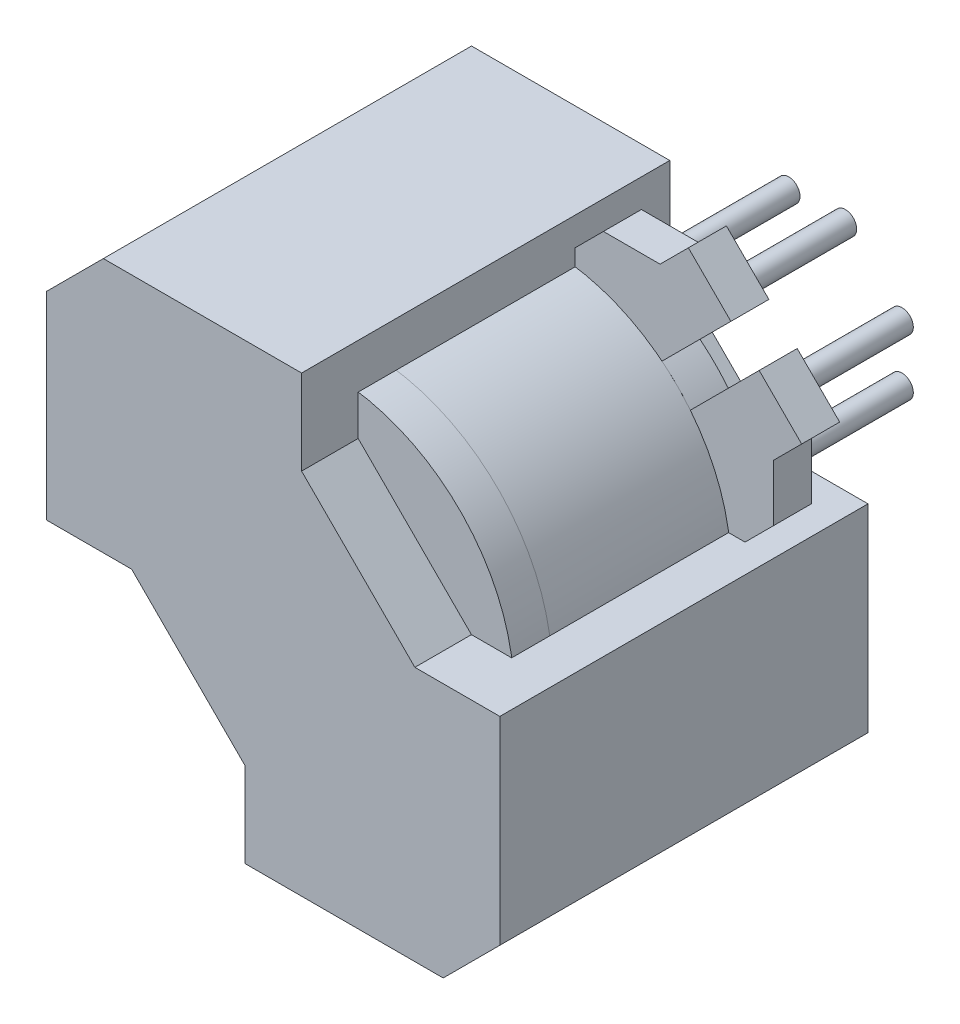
ISO-10303-21;
HEADER;
FILE_DESCRIPTION(('STEP AP214'),'2;1');
FILE_NAME('part.step','',(''),(''),'','','');
FILE_SCHEMA(('AUTOMOTIVE_DESIGN { 1 0 10303 214 1 1 1 1 }'));
ENDSEC;
DATA;
#1=APPLICATION_CONTEXT('core data for automotive mechanical design processes');
#2=APPLICATION_PROTOCOL_DEFINITION('international standard','automotive_design',2000,#1);
#3=PRODUCT_CONTEXT('',#1,'mechanical');
#4=PRODUCT('Part','Part','',(#3));
#5=PRODUCT_RELATED_PRODUCT_CATEGORY('part','',(#4));
#6=PRODUCT_DEFINITION_FORMATION('','',#4);
#7=PRODUCT_DEFINITION_CONTEXT('part definition',#1,'design');
#8=PRODUCT_DEFINITION('design','',#6,#7);
#9=PRODUCT_DEFINITION_SHAPE('','',#8);
#10=(LENGTH_UNIT() NAMED_UNIT(*) SI_UNIT(.MILLI.,.METRE.));
#11=(NAMED_UNIT(*) PLANE_ANGLE_UNIT() SI_UNIT($,.RADIAN.));
#12=(NAMED_UNIT(*) SI_UNIT($,.STERADIAN.) SOLID_ANGLE_UNIT());
#13=UNCERTAINTY_MEASURE_WITH_UNIT(LENGTH_MEASURE(1.E-05),#10,'distance_accuracy_value','');
#14=(GEOMETRIC_REPRESENTATION_CONTEXT(3) GLOBAL_UNCERTAINTY_ASSIGNED_CONTEXT((#13)) GLOBAL_UNIT_ASSIGNED_CONTEXT((#10,
#11,#12)) REPRESENTATION_CONTEXT('',''));
#15=CARTESIAN_POINT('',(0.,0.,0.));
#16=DIRECTION('',(0.,0.,1.));
#17=DIRECTION('',(1.,0.,0.));
#18=AXIS2_PLACEMENT_3D('',#15,#16,#17);
#19=CARTESIAN_POINT('',(0.,0.,11.43));
#20=DIRECTION('',(0.,0.,-1.));
#21=DIRECTION('',(-1.,0.,0.));
#22=AXIS2_PLACEMENT_3D('',#19,#20,#21);
#23=CYLINDRICAL_SURFACE('',#22,8.255);
#24=CARTESIAN_POINT('',(0.,0.,11.43));
#25=DIRECTION('',(0.,0.,1.));
#26=DIRECTION('',(1.,0.,0.));
#27=AXIS2_PLACEMENT_3D('',#24,#25,#26);
#28=CIRCLE('',#27,8.255);
#29=CARTESIAN_POINT('',(8.255,0.,11.43));
#30=VERTEX_POINT('',#29);
#31=EDGE_CURVE('E11',#30,#30,#28,.T.);
#32=ORIENTED_EDGE('',*,*,#31,.F.);
#33=EDGE_LOOP('',(#32));
#34=FACE_BOUND('',#33,.T.);
#35=CARTESIAN_POINT('',(0.,0.,9.7282));
#36=DIRECTION('',(0.,0.,1.));
#37=DIRECTION('',(1.,0.,0.));
#38=AXIS2_PLACEMENT_3D('',#35,#36,#37);
#39=CIRCLE('',#38,8.255);
#40=CARTESIAN_POINT('',(8.255,0.,9.7282));
#41=VERTEX_POINT('',#40);
#42=EDGE_CURVE('E41',#41,#41,#39,.T.);
#43=ORIENTED_EDGE('',*,*,#42,.T.);
#44=EDGE_LOOP('',(#43));
#45=FACE_BOUND('',#44,.T.);
#46=ADVANCED_FACE('F38',(#34,#45),#23,.T.);
#47=CARTESIAN_POINT('',(0.,0.,11.43));
#48=DIRECTION('',(0.,0.,1.));
#49=DIRECTION('',(1.,0.,0.));
#50=AXIS2_PLACEMENT_3D('',#47,#48,#49);
#51=PLANE('',#50);
#52=ORIENTED_EDGE('',*,*,#31,.T.);
#53=EDGE_LOOP('',(#52));
#54=FACE_BOUND('',#53,.T.);
#55=ADVANCED_FACE('F53',(#54),#51,.T.);
#56=CARTESIAN_POINT('',(0.,0.,9.7282));
#57=DIRECTION('',(0.,0.,1.));
#58=DIRECTION('',(1.,0.,0.));
#59=AXIS2_PLACEMENT_3D('',#56,#57,#58);
#60=PLANE('',#59);
#61=ORIENTED_EDGE('',*,*,#42,.F.);
#62=EDGE_LOOP('',(#61));
#63=FACE_BOUND('',#62,.T.);
#64=ADVANCED_FACE('F51',(#63),#60,.F.);
#65=CLOSED_SHELL('',(#46,#55,#64));
#66=MANIFOLD_SOLID_BREP('B2',#65);
#67=CARTESIAN_POINT('',(0.,0.,9.7282));
#68=DIRECTION('',(0.,0.,-1.));
#69=DIRECTION('',(-1.,0.,0.));
#70=AXIS2_PLACEMENT_3D('',#67,#68,#69);
#71=CYLINDRICAL_SURFACE('',#70,8.255);
#72=CARTESIAN_POINT('',(0.,0.,9.7282));
#73=DIRECTION('',(0.,0.,1.));
#74=DIRECTION('',(1.,0.,0.));
#75=AXIS2_PLACEMENT_3D('',#72,#73,#74);
#76=CIRCLE('',#75,8.255);
#77=CARTESIAN_POINT('',(8.255,0.,9.7282));
#78=VERTEX_POINT('',#77);
#79=EDGE_CURVE('E37',#78,#78,#76,.T.);
#80=ORIENTED_EDGE('',*,*,#79,.F.);
#81=EDGE_LOOP('',(#80));
#82=FACE_BOUND('',#81,.T.);
#83=CARTESIAN_POINT('',(0.,0.,1.7018));
#84=DIRECTION('',(0.,0.,1.));
#85=DIRECTION('',(1.,0.,0.));
#86=AXIS2_PLACEMENT_3D('',#83,#84,#85);
#87=CIRCLE('',#86,8.255);
#88=CARTESIAN_POINT('',(8.255,0.,1.7018));
#89=VERTEX_POINT('',#88);
#90=EDGE_CURVE('E92',#89,#89,#87,.T.);
#91=ORIENTED_EDGE('',*,*,#90,.T.);
#92=EDGE_LOOP('',(#91));
#93=FACE_BOUND('',#92,.T.);
#94=ADVANCED_FACE('F89',(#82,#93),#71,.T.);
#95=CARTESIAN_POINT('',(0.,0.,9.7282));
#96=DIRECTION('',(0.,0.,1.));
#97=DIRECTION('',(1.,0.,0.));
#98=AXIS2_PLACEMENT_3D('',#95,#96,#97);
#99=PLANE('',#98);
#100=ORIENTED_EDGE('',*,*,#79,.T.);
#101=EDGE_LOOP('',(#100));
#102=FACE_BOUND('',#101,.T.);
#103=ADVANCED_FACE('F104',(#102),#99,.T.);
#104=CARTESIAN_POINT('',(0.,0.,1.7018));
#105=DIRECTION('',(0.,0.,1.));
#106=DIRECTION('',(1.,0.,0.));
#107=AXIS2_PLACEMENT_3D('',#104,#105,#106);
#108=PLANE('',#107);
#109=ORIENTED_EDGE('',*,*,#90,.F.);
#110=EDGE_LOOP('',(#109));
#111=FACE_BOUND('',#110,.T.);
#112=ADVANCED_FACE('F102',(#111),#108,.F.);
#113=CLOSED_SHELL('',(#94,#103,#112));
#114=MANIFOLD_SOLID_BREP('B6',#113);
#115=CARTESIAN_POINT('',(-1.27000000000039,-6.3499999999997,13.96746));
#116=DIRECTION('',(-1.,0.,0.));
#117=DIRECTION('',(0.,0.,1.));
#118=AXIS2_PLACEMENT_3D('',#115,#116,#117);
#119=PLANE('',#118);
#120=DIRECTION('',(0.,0.,-1.));
#121=VECTOR('',#120,1.);
#122=CARTESIAN_POINT('',(-1.27000000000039,-6.3499999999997,13.96746));
#123=LINE('',#122,#121);
#124=CARTESIAN_POINT('',(-1.27000000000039,-6.3499999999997,13.96746));
#125=VERTEX_POINT('',#124);
#126=CARTESIAN_POINT('',(-1.27000000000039,-6.3499999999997,-2.54254));
#127=VERTEX_POINT('',#126);
#128=EDGE_CURVE('E141',#125,#127,#123,.T.);
#129=ORIENTED_EDGE('',*,*,#128,.T.);
#130=DIRECTION('',(0.,1.,0.));
#131=VECTOR('',#130,1.);
#132=CARTESIAN_POINT('',(-1.27000000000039,-6.3499999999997,-2.54254));
#133=LINE('',#132,#131);
#134=CARTESIAN_POINT('',(-1.27000000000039,-10.16,-2.54254));
#135=VERTEX_POINT('',#134);
#136=EDGE_CURVE('E226',#135,#127,#133,.T.);
#137=ORIENTED_EDGE('',*,*,#136,.F.);
#138=DIRECTION('',(0.,0.,-1.));
#139=VECTOR('',#138,1.);
#140=CARTESIAN_POINT('',(-1.27000000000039,-10.16,13.96746));
#141=LINE('',#140,#139);
#142=CARTESIAN_POINT('',(-1.27000000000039,-10.16,13.96746));
#143=VERTEX_POINT('',#142);
#144=EDGE_CURVE('E87',#143,#135,#141,.T.);
#145=ORIENTED_EDGE('',*,*,#144,.F.);
#146=DIRECTION('',(0.,1.,0.));
#147=VECTOR('',#146,1.);
#148=CARTESIAN_POINT('',(-1.27000000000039,-6.3499999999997,13.96746));
#149=LINE('',#148,#147);
#150=EDGE_CURVE('E227',#143,#125,#149,.T.);
#151=ORIENTED_EDGE('',*,*,#150,.T.);
#152=EDGE_LOOP('',(#129,#137,#145,#151));
#153=FACE_BOUND('',#152,.T.);
#154=ADVANCED_FACE('F138',(#153),#119,.T.);
#155=CARTESIAN_POINT('',(-1.27000000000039,-10.16,13.96746));
#156=DIRECTION('',(0.,-1.,0.));
#157=DIRECTION('',(1.,0.,0.));
#158=AXIS2_PLACEMENT_3D('',#155,#156,#157);
#159=PLANE('',#158);
#160=ORIENTED_EDGE('',*,*,#144,.T.);
#161=DIRECTION('',(-1.,0.,0.));
#162=VECTOR('',#161,1.);
#163=CARTESIAN_POINT('',(-1.27000000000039,-10.16,-2.54254));
#164=LINE('',#163,#162);
#165=CARTESIAN_POINT('',(7.61999999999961,-10.16,-2.54254));
#166=VERTEX_POINT('',#165);
#167=EDGE_CURVE('E244',#166,#135,#164,.T.);
#168=ORIENTED_EDGE('',*,*,#167,.F.);
#169=DIRECTION('',(0.,0.,-1.));
#170=VECTOR('',#169,1.);
#171=CARTESIAN_POINT('',(7.61999999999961,-10.16,13.96746));
#172=LINE('',#171,#170);
#173=CARTESIAN_POINT('',(7.61999999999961,-10.16,13.96746));
#174=VERTEX_POINT('',#173);
#175=EDGE_CURVE('E146',#174,#166,#172,.T.);
#176=ORIENTED_EDGE('',*,*,#175,.F.);
#177=DIRECTION('',(-1.,0.,0.));
#178=VECTOR('',#177,1.);
#179=CARTESIAN_POINT('',(-1.27000000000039,-10.16,13.96746));
#180=LINE('',#179,#178);
#181=EDGE_CURVE('E232',#174,#143,#180,.T.);
#182=ORIENTED_EDGE('',*,*,#181,.T.);
#183=EDGE_LOOP('',(#160,#168,#176,#182));
#184=FACE_BOUND('',#183,.T.);
#185=ADVANCED_FACE('F356',(#184),#159,.T.);
#186=CARTESIAN_POINT('',(7.61999999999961,-10.16,13.96746));
#187=DIRECTION('',(0.707106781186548,-0.707106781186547,0.));
#188=DIRECTION('',(0.707106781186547,0.707106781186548,0.));
#189=AXIS2_PLACEMENT_3D('',#186,#187,#188);
#190=PLANE('',#189);
#191=ORIENTED_EDGE('',*,*,#175,.T.);
#192=DIRECTION('',(-0.707106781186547,-0.707106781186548,0.));
#193=VECTOR('',#192,1.);
#194=CARTESIAN_POINT('',(7.61999999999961,-10.16,-2.54254));
#195=LINE('',#194,#193);
#196=CARTESIAN_POINT('',(10.1599999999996,-7.62,-2.54254));
#197=VERTEX_POINT('',#196);
#198=EDGE_CURVE('E269',#197,#166,#195,.T.);
#199=ORIENTED_EDGE('',*,*,#198,.F.);
#200=DIRECTION('',(0.,0.,-1.));
#201=VECTOR('',#200,1.);
#202=CARTESIAN_POINT('',(10.1599999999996,-7.62,13.96746));
#203=LINE('',#202,#201);
#204=CARTESIAN_POINT('',(10.1599999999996,-7.62,13.96746));
#205=VERTEX_POINT('',#204);
#206=EDGE_CURVE('E303',#205,#197,#203,.T.);
#207=ORIENTED_EDGE('',*,*,#206,.F.);
#208=DIRECTION('',(-0.707106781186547,-0.707106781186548,0.));
#209=VECTOR('',#208,1.);
#210=CARTESIAN_POINT('',(7.61999999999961,-10.16,13.96746));
#211=LINE('',#210,#209);
#212=EDGE_CURVE('E299',#205,#174,#211,.T.);
#213=ORIENTED_EDGE('',*,*,#212,.T.);
#214=EDGE_LOOP('',(#191,#199,#207,#213));
#215=FACE_BOUND('',#214,.T.);
#216=ADVANCED_FACE('F354',(#215),#190,.T.);
#217=CARTESIAN_POINT('',(10.1599999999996,-7.62,13.96746));
#218=DIRECTION('',(1.,0.,0.));
#219=DIRECTION('',(0.,0.,-1.));
#220=AXIS2_PLACEMENT_3D('',#217,#218,#219);
#221=PLANE('',#220);
#222=ORIENTED_EDGE('',*,*,#206,.T.);
#223=DIRECTION('',(0.,-1.,0.));
#224=VECTOR('',#223,1.);
#225=CARTESIAN_POINT('',(10.1599999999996,-7.62,-2.54254));
#226=LINE('',#225,#224);
#227=CARTESIAN_POINT('',(10.1599999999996,1.27,-2.54254));
#228=VERTEX_POINT('',#227);
#229=EDGE_CURVE('E266',#228,#197,#226,.T.);
#230=ORIENTED_EDGE('',*,*,#229,.F.);
#231=DIRECTION('',(0.,0.,-1.));
#232=VECTOR('',#231,1.);
#233=CARTESIAN_POINT('',(10.1599999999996,1.27,13.96746));
#234=LINE('',#233,#232);
#235=CARTESIAN_POINT('',(10.1599999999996,1.27,13.96746));
#236=VERTEX_POINT('',#235);
#237=EDGE_CURVE('E305',#236,#228,#234,.T.);
#238=ORIENTED_EDGE('',*,*,#237,.F.);
#239=DIRECTION('',(0.,-1.,0.));
#240=VECTOR('',#239,1.);
#241=CARTESIAN_POINT('',(10.1599999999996,-7.62,13.96746));
#242=LINE('',#241,#240);
#243=EDGE_CURVE('E296',#236,#205,#242,.T.);
#244=ORIENTED_EDGE('',*,*,#243,.T.);
#245=EDGE_LOOP('',(#222,#230,#238,#244));
#246=FACE_BOUND('',#245,.T.);
#247=ADVANCED_FACE('F352',(#246),#221,.T.);
#248=CARTESIAN_POINT('',(10.1599999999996,1.27,13.96746));
#249=DIRECTION('',(0.,1.,0.));
#250=DIRECTION('',(0.,0.,1.));
#251=AXIS2_PLACEMENT_3D('',#248,#249,#250);
#252=PLANE('',#251);
#253=ORIENTED_EDGE('',*,*,#237,.T.);
#254=DIRECTION('',(1.,0.,0.));
#255=VECTOR('',#254,1.);
#256=CARTESIAN_POINT('',(10.1599999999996,1.27,-2.54254));
#257=LINE('',#256,#255);
#258=CARTESIAN_POINT('',(6.35,1.27,-2.54254));
#259=VERTEX_POINT('',#258);
#260=EDGE_CURVE('E263',#259,#228,#257,.T.);
#261=ORIENTED_EDGE('',*,*,#260,.F.);
#262=DIRECTION('',(0.,0.,-1.));
#263=VECTOR('',#262,1.);
#264=CARTESIAN_POINT('',(6.35,1.27,13.96746));
#265=LINE('',#264,#263);
#266=CARTESIAN_POINT('',(6.35,1.27,13.96746));
#267=VERTEX_POINT('',#266);
#268=EDGE_CURVE('E307',#267,#259,#265,.T.);
#269=ORIENTED_EDGE('',*,*,#268,.F.);
#270=DIRECTION('',(1.,0.,0.));
#271=VECTOR('',#270,1.);
#272=CARTESIAN_POINT('',(10.1599999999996,1.27,13.96746));
#273=LINE('',#272,#271);
#274=EDGE_CURVE('E293',#267,#236,#273,.T.);
#275=ORIENTED_EDGE('',*,*,#274,.T.);
#276=EDGE_LOOP('',(#253,#261,#269,#275));
#277=FACE_BOUND('',#276,.T.);
#278=ADVANCED_FACE('F347',(#277),#252,.T.);
#279=CARTESIAN_POINT('',(6.35,1.27,13.96746));
#280=DIRECTION('',(0.707106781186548,0.707106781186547,0.));
#281=DIRECTION('',(-0.707106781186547,0.707106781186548,0.));
#282=AXIS2_PLACEMENT_3D('',#279,#280,#281);
#283=PLANE('',#282);
#284=ORIENTED_EDGE('',*,*,#268,.T.);
#285=DIRECTION('',(0.707106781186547,-0.707106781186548,0.));
#286=VECTOR('',#285,1.);
#287=CARTESIAN_POINT('',(6.35,1.27,-2.54254));
#288=LINE('',#287,#286);
#289=CARTESIAN_POINT('',(1.27,6.35,-2.54254));
#290=VERTEX_POINT('',#289);
#291=EDGE_CURVE('E260',#290,#259,#288,.T.);
#292=ORIENTED_EDGE('',*,*,#291,.F.);
#293=DIRECTION('',(0.,0.,-1.));
#294=VECTOR('',#293,1.);
#295=CARTESIAN_POINT('',(1.27,6.35,13.96746));
#296=LINE('',#295,#294);
#297=CARTESIAN_POINT('',(1.27,6.35,13.96746));
#298=VERTEX_POINT('',#297);
#299=EDGE_CURVE('E309',#298,#290,#296,.T.);
#300=ORIENTED_EDGE('',*,*,#299,.F.);
#301=DIRECTION('',(0.707106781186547,-0.707106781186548,0.));
#302=VECTOR('',#301,1.);
#303=CARTESIAN_POINT('',(6.35,1.27,13.96746));
#304=LINE('',#303,#302);
#305=EDGE_CURVE('E290',#298,#267,#304,.T.);
#306=ORIENTED_EDGE('',*,*,#305,.T.);
#307=EDGE_LOOP('',(#284,#292,#300,#306));
#308=FACE_BOUND('',#307,.T.);
#309=ADVANCED_FACE('F342',(#308),#283,.T.);
#310=CARTESIAN_POINT('',(1.27,6.35,13.96746));
#311=DIRECTION('',(1.,0.,0.));
#312=DIRECTION('',(0.,0.,-1.));
#313=AXIS2_PLACEMENT_3D('',#310,#311,#312);
#314=PLANE('',#313);
#315=ORIENTED_EDGE('',*,*,#299,.T.);
#316=DIRECTION('',(0.,-1.,0.));
#317=VECTOR('',#316,1.);
#318=CARTESIAN_POINT('',(1.27,6.35,-2.54254));
#319=LINE('',#318,#317);
#320=CARTESIAN_POINT('',(1.27,10.16,-2.54254));
#321=VERTEX_POINT('',#320);
#322=EDGE_CURVE('E257',#321,#290,#319,.T.);
#323=ORIENTED_EDGE('',*,*,#322,.F.);
#324=DIRECTION('',(0.,0.,-1.));
#325=VECTOR('',#324,1.);
#326=CARTESIAN_POINT('',(1.27,10.16,13.96746));
#327=LINE('',#326,#325);
#328=CARTESIAN_POINT('',(1.27,10.16,13.96746));
#329=VERTEX_POINT('',#328);
#330=EDGE_CURVE('E311',#329,#321,#327,.T.);
#331=ORIENTED_EDGE('',*,*,#330,.F.);
#332=DIRECTION('',(0.,-1.,0.));
#333=VECTOR('',#332,1.);
#334=CARTESIAN_POINT('',(1.27,6.35,13.96746));
#335=LINE('',#334,#333);
#336=EDGE_CURVE('E287',#329,#298,#335,.T.);
#337=ORIENTED_EDGE('',*,*,#336,.T.);
#338=EDGE_LOOP('',(#315,#323,#331,#337));
#339=FACE_BOUND('',#338,.T.);
#340=ADVANCED_FACE('F340',(#339),#314,.T.);
#341=CARTESIAN_POINT('',(1.27,10.16,13.96746));
#342=DIRECTION('',(0.,1.,0.));
#343=DIRECTION('',(0.,0.,1.));
#344=AXIS2_PLACEMENT_3D('',#341,#342,#343);
#345=PLANE('',#344);
#346=ORIENTED_EDGE('',*,*,#330,.T.);
#347=DIRECTION('',(1.,0.,0.));
#348=VECTOR('',#347,1.);
#349=CARTESIAN_POINT('',(1.27,10.16,-2.54254));
#350=LINE('',#349,#348);
#351=CARTESIAN_POINT('',(-7.62,10.16,-2.54254));
#352=VERTEX_POINT('',#351);
#353=EDGE_CURVE('E254',#352,#321,#350,.T.);
#354=ORIENTED_EDGE('',*,*,#353,.F.);
#355=DIRECTION('',(0.,0.,-1.));
#356=VECTOR('',#355,1.);
#357=CARTESIAN_POINT('',(-7.62,10.16,13.96746));
#358=LINE('',#357,#356);
#359=CARTESIAN_POINT('',(-7.62,10.16,13.96746));
#360=VERTEX_POINT('',#359);
#361=EDGE_CURVE('E313',#360,#352,#358,.T.);
#362=ORIENTED_EDGE('',*,*,#361,.F.);
#363=DIRECTION('',(1.,0.,0.));
#364=VECTOR('',#363,1.);
#365=CARTESIAN_POINT('',(1.27,10.16,13.96746));
#366=LINE('',#365,#364);
#367=EDGE_CURVE('E284',#360,#329,#366,.T.);
#368=ORIENTED_EDGE('',*,*,#367,.T.);
#369=EDGE_LOOP('',(#346,#354,#362,#368));
#370=FACE_BOUND('',#369,.T.);
#371=ADVANCED_FACE('F335',(#370),#345,.T.);
#372=CARTESIAN_POINT('',(-7.62,10.16,13.96746));
#373=DIRECTION('',(-0.707106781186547,0.707106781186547,0.));
#374=DIRECTION('',(-0.707106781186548,-0.707106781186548,0.));
#375=AXIS2_PLACEMENT_3D('',#372,#373,#374);
#376=PLANE('',#375);
#377=ORIENTED_EDGE('',*,*,#361,.T.);
#378=DIRECTION('',(0.707106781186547,0.707106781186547,0.));
#379=VECTOR('',#378,1.);
#380=CARTESIAN_POINT('',(-7.62,10.16,-2.54254));
#381=LINE('',#380,#379);
#382=CARTESIAN_POINT('',(-10.16,7.62,-2.54254));
#383=VERTEX_POINT('',#382);
#384=EDGE_CURVE('E251',#383,#352,#381,.T.);
#385=ORIENTED_EDGE('',*,*,#384,.F.);
#386=DIRECTION('',(0.,0.,-1.));
#387=VECTOR('',#386,1.);
#388=CARTESIAN_POINT('',(-10.16,7.62,13.96746));
#389=LINE('',#388,#387);
#390=CARTESIAN_POINT('',(-10.16,7.62,13.96746));
#391=VERTEX_POINT('',#390);
#392=EDGE_CURVE('E315',#391,#383,#389,.T.);
#393=ORIENTED_EDGE('',*,*,#392,.F.);
#394=DIRECTION('',(0.707106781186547,0.707106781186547,0.));
#395=VECTOR('',#394,1.);
#396=CARTESIAN_POINT('',(-7.62,10.16,13.96746));
#397=LINE('',#396,#395);
#398=EDGE_CURVE('E281',#391,#360,#397,.T.);
#399=ORIENTED_EDGE('',*,*,#398,.T.);
#400=EDGE_LOOP('',(#377,#385,#393,#399));
#401=FACE_BOUND('',#400,.T.);
#402=ADVANCED_FACE('F328',(#401),#376,.T.);
#403=CARTESIAN_POINT('',(-10.16,7.62,13.96746));
#404=DIRECTION('',(-1.,0.,0.));
#405=DIRECTION('',(0.,0.,1.));
#406=AXIS2_PLACEMENT_3D('',#403,#404,#405);
#407=PLANE('',#406);
#408=ORIENTED_EDGE('',*,*,#392,.T.);
#409=DIRECTION('',(0.,1.,0.));
#410=VECTOR('',#409,1.);
#411=CARTESIAN_POINT('',(-10.16,7.62,-2.54254));
#412=LINE('',#411,#410);
#413=CARTESIAN_POINT('',(-10.16,-1.27,-2.54254));
#414=VERTEX_POINT('',#413);
#415=EDGE_CURVE('E248',#414,#383,#412,.T.);
#416=ORIENTED_EDGE('',*,*,#415,.F.);
#417=DIRECTION('',(0.,0.,-1.));
#418=VECTOR('',#417,1.);
#419=CARTESIAN_POINT('',(-10.16,-1.27,13.96746));
#420=LINE('',#419,#418);
#421=CARTESIAN_POINT('',(-10.16,-1.27,13.96746));
#422=VERTEX_POINT('',#421);
#423=EDGE_CURVE('E317',#422,#414,#420,.T.);
#424=ORIENTED_EDGE('',*,*,#423,.F.);
#425=DIRECTION('',(0.,1.,0.));
#426=VECTOR('',#425,1.);
#427=CARTESIAN_POINT('',(-10.16,7.62,13.96746));
#428=LINE('',#427,#426);
#429=EDGE_CURVE('E278',#422,#391,#428,.T.);
#430=ORIENTED_EDGE('',*,*,#429,.T.);
#431=EDGE_LOOP('',(#408,#416,#424,#430));
#432=FACE_BOUND('',#431,.T.);
#433=ADVANCED_FACE('F325',(#432),#407,.T.);
#434=CARTESIAN_POINT('',(-10.16,-1.27,13.96746));
#435=DIRECTION('',(0.,-1.,0.));
#436=DIRECTION('',(0.,0.,-1.));
#437=AXIS2_PLACEMENT_3D('',#434,#435,#436);
#438=PLANE('',#437);
#439=ORIENTED_EDGE('',*,*,#423,.T.);
#440=DIRECTION('',(-1.,0.,0.));
#441=VECTOR('',#440,1.);
#442=CARTESIAN_POINT('',(-10.16,-1.27,-2.54254));
#443=LINE('',#442,#441);
#444=CARTESIAN_POINT('',(-6.35,-1.27,-2.54254));
#445=VERTEX_POINT('',#444);
#446=EDGE_CURVE('E239',#445,#414,#443,.T.);
#447=ORIENTED_EDGE('',*,*,#446,.F.);
#448=DIRECTION('',(0.,0.,-1.));
#449=VECTOR('',#448,1.);
#450=CARTESIAN_POINT('',(-6.35,-1.27,13.96746));
#451=LINE('',#450,#449);
#452=CARTESIAN_POINT('',(-6.35,-1.27,13.96746));
#453=VERTEX_POINT('',#452);
#454=EDGE_CURVE('E231',#453,#445,#451,.T.);
#455=ORIENTED_EDGE('',*,*,#454,.F.);
#456=DIRECTION('',(-1.,0.,0.));
#457=VECTOR('',#456,1.);
#458=CARTESIAN_POINT('',(-10.16,-1.27,13.96746));
#459=LINE('',#458,#457);
#460=EDGE_CURVE('E275',#453,#422,#459,.T.);
#461=ORIENTED_EDGE('',*,*,#460,.T.);
#462=EDGE_LOOP('',(#439,#447,#455,#461));
#463=FACE_BOUND('',#462,.T.);
#464=ADVANCED_FACE('F319',(#463),#438,.T.);
#465=CARTESIAN_POINT('',(-6.35,-1.27,13.96746));
#466=DIRECTION('',(-0.707106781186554,-0.707106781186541,0.));
#467=DIRECTION('',(0.707106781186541,-0.707106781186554,0.));
#468=AXIS2_PLACEMENT_3D('',#465,#466,#467);
#469=PLANE('',#468);
#470=ORIENTED_EDGE('',*,*,#454,.T.);
#471=DIRECTION('',(-0.707106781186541,0.707106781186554,0.));
#472=VECTOR('',#471,1.);
#473=CARTESIAN_POINT('',(-6.35,-1.27,-2.54254));
#474=LINE('',#473,#472);
#475=EDGE_CURVE('E234',#127,#445,#474,.T.);
#476=ORIENTED_EDGE('',*,*,#475,.F.);
#477=ORIENTED_EDGE('',*,*,#128,.F.);
#478=DIRECTION('',(-0.707106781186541,0.707106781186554,0.));
#479=VECTOR('',#478,1.);
#480=CARTESIAN_POINT('',(-6.35,-1.27,13.96746));
#481=LINE('',#480,#479);
#482=EDGE_CURVE('E273',#125,#453,#481,.T.);
#483=ORIENTED_EDGE('',*,*,#482,.T.);
#484=EDGE_LOOP('',(#470,#476,#477,#483));
#485=FACE_BOUND('',#484,.T.);
#486=ADVANCED_FACE('F235',(#485),#469,.T.);
#487=CARTESIAN_POINT('',(-1.27000000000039,-10.16,13.96746));
#488=DIRECTION('',(0.,0.,1.));
#489=DIRECTION('',(1.,0.,0.));
#490=AXIS2_PLACEMENT_3D('',#487,#488,#489);
#491=PLANE('',#490);
#492=ORIENTED_EDGE('',*,*,#150,.F.);
#493=ORIENTED_EDGE('',*,*,#181,.F.);
#494=ORIENTED_EDGE('',*,*,#212,.F.);
#495=ORIENTED_EDGE('',*,*,#243,.F.);
#496=ORIENTED_EDGE('',*,*,#274,.F.);
#497=ORIENTED_EDGE('',*,*,#305,.F.);
#498=ORIENTED_EDGE('',*,*,#336,.F.);
#499=ORIENTED_EDGE('',*,*,#367,.F.);
#500=ORIENTED_EDGE('',*,*,#398,.F.);
#501=ORIENTED_EDGE('',*,*,#429,.F.);
#502=ORIENTED_EDGE('',*,*,#460,.F.);
#503=ORIENTED_EDGE('',*,*,#482,.F.);
#504=EDGE_LOOP('',(#492,#493,#494,#495,#496,#497,#498,#499,#500,#501,#502,#503));
#505=FACE_BOUND('',#504,.T.);
#506=ADVANCED_FACE('F331',(#505),#491,.T.);
#507=CARTESIAN_POINT('',(-1.27000000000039,-10.16,-2.54254));
#508=DIRECTION('',(0.,0.,1.));
#509=DIRECTION('',(1.,0.,0.));
#510=AXIS2_PLACEMENT_3D('',#507,#508,#509);
#511=PLANE('',#510);
#512=ORIENTED_EDGE('',*,*,#136,.T.);
#513=ORIENTED_EDGE('',*,*,#475,.T.);
#514=ORIENTED_EDGE('',*,*,#446,.T.);
#515=ORIENTED_EDGE('',*,*,#415,.T.);
#516=ORIENTED_EDGE('',*,*,#384,.T.);
#517=ORIENTED_EDGE('',*,*,#353,.T.);
#518=ORIENTED_EDGE('',*,*,#322,.T.);
#519=ORIENTED_EDGE('',*,*,#291,.T.);
#520=ORIENTED_EDGE('',*,*,#260,.T.);
#521=ORIENTED_EDGE('',*,*,#229,.T.);
#522=ORIENTED_EDGE('',*,*,#198,.T.);
#523=ORIENTED_EDGE('',*,*,#167,.T.);
#524=EDGE_LOOP('',(#512,#513,#514,#515,#516,#517,#518,#519,#520,#521,#522,#523));
#525=FACE_BOUND('',#524,.T.);
#526=ADVANCED_FACE('F242',(#525),#511,.F.);
#527=CLOSED_SHELL('',(#154,#185,#216,#247,#278,#309,#340,#371,#402,#433,#464,#486,#506,#526));
#528=MANIFOLD_SOLID_BREP('B32',#527);
#529=CARTESIAN_POINT('',(6.35,3.81,-5.33654));
#530=DIRECTION('',(0.,0.,1.));
#531=DIRECTION('',(1.,0.,0.));
#532=AXIS2_PLACEMENT_3D('',#529,#530,#531);
#533=CYLINDRICAL_SURFACE('',#532,0.508);
#534=CARTESIAN_POINT('',(6.35,3.81,-5.33654));
#535=DIRECTION('',(0.,0.,-1.));
#536=DIRECTION('',(-1.,0.,0.));
#537=AXIS2_PLACEMENT_3D('',#534,#535,#536);
#538=CIRCLE('',#537,0.508);
#539=CARTESIAN_POINT('',(5.842,3.81,-5.33654));
#540=VERTEX_POINT('',#539);
#541=EDGE_CURVE('E137',#540,#540,#538,.T.);
#542=ORIENTED_EDGE('',*,*,#541,.F.);
#543=EDGE_LOOP('',(#542));
#544=FACE_BOUND('',#543,.T.);
#545=CARTESIAN_POINT('',(6.35,3.81,-0.00254));
#546=DIRECTION('',(0.,0.,-1.));
#547=DIRECTION('',(-1.,0.,0.));
#548=AXIS2_PLACEMENT_3D('',#545,#546,#547);
#549=CIRCLE('',#548,0.508);
#550=CARTESIAN_POINT('',(5.842,3.81,-0.00254));
#551=VERTEX_POINT('',#550);
#552=EDGE_CURVE('E481',#551,#551,#549,.T.);
#553=ORIENTED_EDGE('',*,*,#552,.T.);
#554=EDGE_LOOP('',(#553));
#555=FACE_BOUND('',#554,.T.);
#556=ADVANCED_FACE('F478',(#544,#555),#533,.T.);
#557=CARTESIAN_POINT('',(6.35,3.81,-5.33654));
#558=DIRECTION('',(0.,0.,-1.));
#559=DIRECTION('',(-1.,0.,0.));
#560=AXIS2_PLACEMENT_3D('',#557,#558,#559);
#561=PLANE('',#560);
#562=ORIENTED_EDGE('',*,*,#541,.T.);
#563=EDGE_LOOP('',(#562));
#564=FACE_BOUND('',#563,.T.);
#565=ADVANCED_FACE('F493',(#564),#561,.T.);
#566=CARTESIAN_POINT('',(6.35,3.81,-0.00254));
#567=DIRECTION('',(0.,0.,-1.));
#568=DIRECTION('',(-1.,0.,0.));
#569=AXIS2_PLACEMENT_3D('',#566,#567,#568);
#570=PLANE('',#569);
#571=ORIENTED_EDGE('',*,*,#552,.F.);
#572=EDGE_LOOP('',(#571));
#573=FACE_BOUND('',#572,.T.);
#574=ADVANCED_FACE('F491',(#573),#570,.F.);
#575=CLOSED_SHELL('',(#556,#565,#574));
#576=MANIFOLD_SOLID_BREP('B81',#575);
#577=CARTESIAN_POINT('',(8.89,3.81,-5.33654));
#578=DIRECTION('',(0.,0.,1.));
#579=DIRECTION('',(1.,0.,0.));
#580=AXIS2_PLACEMENT_3D('',#577,#578,#579);
#581=CYLINDRICAL_SURFACE('',#580,0.508);
#582=CARTESIAN_POINT('',(8.89,3.81,-5.33654));
#583=DIRECTION('',(0.,0.,-1.));
#584=DIRECTION('',(-1.,0.,0.));
#585=AXIS2_PLACEMENT_3D('',#582,#583,#584);
#586=CIRCLE('',#585,0.508);
#587=CARTESIAN_POINT('',(8.382,3.81,-5.33654));
#588=VERTEX_POINT('',#587);
#589=EDGE_CURVE('E477',#588,#588,#586,.T.);
#590=ORIENTED_EDGE('',*,*,#589,.F.);
#591=EDGE_LOOP('',(#590));
#592=FACE_BOUND('',#591,.T.);
#593=CARTESIAN_POINT('',(8.89,3.81,-0.00254));
#594=DIRECTION('',(0.,0.,-1.));
#595=DIRECTION('',(-1.,0.,0.));
#596=AXIS2_PLACEMENT_3D('',#593,#594,#595);
#597=CIRCLE('',#596,0.508);
#598=CARTESIAN_POINT('',(8.382,3.81,-0.00254));
#599=VERTEX_POINT('',#598);
#600=EDGE_CURVE('E530',#599,#599,#597,.T.);
#601=ORIENTED_EDGE('',*,*,#600,.T.);
#602=EDGE_LOOP('',(#601));
#603=FACE_BOUND('',#602,.T.);
#604=ADVANCED_FACE('F527',(#592,#603),#581,.T.);
#605=CARTESIAN_POINT('',(8.89,3.81,-5.33654));
#606=DIRECTION('',(0.,0.,-1.));
#607=DIRECTION('',(-1.,0.,0.));
#608=AXIS2_PLACEMENT_3D('',#605,#606,#607);
#609=PLANE('',#608);
#610=ORIENTED_EDGE('',*,*,#589,.T.);
#611=EDGE_LOOP('',(#610));
#612=FACE_BOUND('',#611,.T.);
#613=ADVANCED_FACE('F542',(#612),#609,.T.);
#614=CARTESIAN_POINT('',(8.89,3.81,-0.00254));
#615=DIRECTION('',(0.,0.,-1.));
#616=DIRECTION('',(-1.,0.,0.));
#617=AXIS2_PLACEMENT_3D('',#614,#615,#616);
#618=PLANE('',#617);
#619=ORIENTED_EDGE('',*,*,#600,.F.);
#620=EDGE_LOOP('',(#619));
#621=FACE_BOUND('',#620,.T.);
#622=ADVANCED_FACE('F540',(#621),#618,.F.);
#623=CLOSED_SHELL('',(#604,#613,#622));
#624=MANIFOLD_SOLID_BREP('B132',#623);
#625=CARTESIAN_POINT('',(8.89,6.35,-5.33654));
#626=DIRECTION('',(0.,0.,1.));
#627=DIRECTION('',(1.,0.,0.));
#628=AXIS2_PLACEMENT_3D('',#625,#626,#627);
#629=CYLINDRICAL_SURFACE('',#628,0.508);
#630=CARTESIAN_POINT('',(8.89,6.35,-5.33654));
#631=DIRECTION('',(0.,0.,-1.));
#632=DIRECTION('',(-1.,0.,0.));
#633=AXIS2_PLACEMENT_3D('',#630,#631,#632);
#634=CIRCLE('',#633,0.508);
#635=CARTESIAN_POINT('',(8.382,6.35,-5.33654));
#636=VERTEX_POINT('',#635);
#637=EDGE_CURVE('E526',#636,#636,#634,.T.);
#638=ORIENTED_EDGE('',*,*,#637,.F.);
#639=EDGE_LOOP('',(#638));
#640=FACE_BOUND('',#639,.T.);
#641=CARTESIAN_POINT('',(8.89,6.35,-0.00254));
#642=DIRECTION('',(0.,0.,-1.));
#643=DIRECTION('',(-1.,0.,0.));
#644=AXIS2_PLACEMENT_3D('',#641,#642,#643);
#645=CIRCLE('',#644,0.508);
#646=CARTESIAN_POINT('',(8.382,6.35,-0.00254));
#647=VERTEX_POINT('',#646);
#648=EDGE_CURVE('E579',#647,#647,#645,.T.);
#649=ORIENTED_EDGE('',*,*,#648,.T.);
#650=EDGE_LOOP('',(#649));
#651=FACE_BOUND('',#650,.T.);
#652=ADVANCED_FACE('F576',(#640,#651),#629,.T.);
#653=CARTESIAN_POINT('',(8.89,6.35,-5.33654));
#654=DIRECTION('',(0.,0.,-1.));
#655=DIRECTION('',(-1.,0.,0.));
#656=AXIS2_PLACEMENT_3D('',#653,#654,#655);
#657=PLANE('',#656);
#658=ORIENTED_EDGE('',*,*,#637,.T.);
#659=EDGE_LOOP('',(#658));
#660=FACE_BOUND('',#659,.T.);
#661=ADVANCED_FACE('F591',(#660),#657,.T.);
#662=CARTESIAN_POINT('',(8.89,6.35,-0.00254));
#663=DIRECTION('',(0.,0.,-1.));
#664=DIRECTION('',(-1.,0.,0.));
#665=AXIS2_PLACEMENT_3D('',#662,#663,#664);
#666=PLANE('',#665);
#667=ORIENTED_EDGE('',*,*,#648,.F.);
#668=EDGE_LOOP('',(#667));
#669=FACE_BOUND('',#668,.T.);
#670=ADVANCED_FACE('F589',(#669),#666,.F.);
#671=CLOSED_SHELL('',(#652,#661,#670));
#672=MANIFOLD_SOLID_BREP('B472',#671);
#673=CARTESIAN_POINT('',(3.81,8.89,-5.33654));
#674=DIRECTION('',(0.,0.,1.));
#675=DIRECTION('',(1.,0.,0.));
#676=AXIS2_PLACEMENT_3D('',#673,#674,#675);
#677=CYLINDRICAL_SURFACE('',#676,0.508);
#678=CARTESIAN_POINT('',(3.81,8.89,-5.33654));
#679=DIRECTION('',(0.,0.,-1.));
#680=DIRECTION('',(-1.,0.,0.));
#681=AXIS2_PLACEMENT_3D('',#678,#679,#680);
#682=CIRCLE('',#681,0.508);
#683=CARTESIAN_POINT('',(3.302,8.89,-5.33654));
#684=VERTEX_POINT('',#683);
#685=EDGE_CURVE('E575',#684,#684,#682,.T.);
#686=ORIENTED_EDGE('',*,*,#685,.F.);
#687=EDGE_LOOP('',(#686));
#688=FACE_BOUND('',#687,.T.);
#689=CARTESIAN_POINT('',(3.81,8.89,-0.00254));
#690=DIRECTION('',(0.,0.,-1.));
#691=DIRECTION('',(-1.,0.,0.));
#692=AXIS2_PLACEMENT_3D('',#689,#690,#691);
#693=CIRCLE('',#692,0.508);
#694=CARTESIAN_POINT('',(3.302,8.89,-0.00254));
#695=VERTEX_POINT('',#694);
#696=EDGE_CURVE('E628',#695,#695,#693,.T.);
#697=ORIENTED_EDGE('',*,*,#696,.T.);
#698=EDGE_LOOP('',(#697));
#699=FACE_BOUND('',#698,.T.);
#700=ADVANCED_FACE('F625',(#688,#699),#677,.T.);
#701=CARTESIAN_POINT('',(3.81,8.89,-5.33654));
#702=DIRECTION('',(0.,0.,-1.));
#703=DIRECTION('',(-1.,0.,0.));
#704=AXIS2_PLACEMENT_3D('',#701,#702,#703);
#705=PLANE('',#704);
#706=ORIENTED_EDGE('',*,*,#685,.T.);
#707=EDGE_LOOP('',(#706));
#708=FACE_BOUND('',#707,.T.);
#709=ADVANCED_FACE('F640',(#708),#705,.T.);
#710=CARTESIAN_POINT('',(3.81,8.89,-0.00254));
#711=DIRECTION('',(0.,0.,-1.));
#712=DIRECTION('',(-1.,0.,0.));
#713=AXIS2_PLACEMENT_3D('',#710,#711,#712);
#714=PLANE('',#713);
#715=ORIENTED_EDGE('',*,*,#696,.F.);
#716=EDGE_LOOP('',(#715));
#717=FACE_BOUND('',#716,.T.);
#718=ADVANCED_FACE('F638',(#717),#714,.F.);
#719=CLOSED_SHELL('',(#700,#709,#718));
#720=MANIFOLD_SOLID_BREP('B521',#719);
#721=CARTESIAN_POINT('',(3.81,6.35,-5.33654));
#722=DIRECTION('',(0.,0.,1.));
#723=DIRECTION('',(1.,0.,0.));
#724=AXIS2_PLACEMENT_3D('',#721,#722,#723);
#725=CYLINDRICAL_SURFACE('',#724,0.508);
#726=CARTESIAN_POINT('',(3.81,6.35,-5.33654));
#727=DIRECTION('',(0.,0.,-1.));
#728=DIRECTION('',(-1.,0.,0.));
#729=AXIS2_PLACEMENT_3D('',#726,#727,#728);
#730=CIRCLE('',#729,0.508);
#731=CARTESIAN_POINT('',(3.302,6.35,-5.33654));
#732=VERTEX_POINT('',#731);
#733=EDGE_CURVE('E624',#732,#732,#730,.T.);
#734=ORIENTED_EDGE('',*,*,#733,.F.);
#735=EDGE_LOOP('',(#734));
#736=FACE_BOUND('',#735,.T.);
#737=CARTESIAN_POINT('',(3.81,6.35,-0.00254));
#738=DIRECTION('',(0.,0.,-1.));
#739=DIRECTION('',(-1.,0.,0.));
#740=AXIS2_PLACEMENT_3D('',#737,#738,#739);
#741=CIRCLE('',#740,0.508);
#742=CARTESIAN_POINT('',(3.302,6.35,-0.00254));
#743=VERTEX_POINT('',#742);
#744=EDGE_CURVE('E677',#743,#743,#741,.T.);
#745=ORIENTED_EDGE('',*,*,#744,.T.);
#746=EDGE_LOOP('',(#745));
#747=FACE_BOUND('',#746,.T.);
#748=ADVANCED_FACE('F674',(#736,#747),#725,.T.);
#749=CARTESIAN_POINT('',(3.81,6.35,-5.33654));
#750=DIRECTION('',(0.,0.,-1.));
#751=DIRECTION('',(-1.,0.,0.));
#752=AXIS2_PLACEMENT_3D('',#749,#750,#751);
#753=PLANE('',#752);
#754=ORIENTED_EDGE('',*,*,#733,.T.);
#755=EDGE_LOOP('',(#754));
#756=FACE_BOUND('',#755,.T.);
#757=ADVANCED_FACE('F689',(#756),#753,.T.);
#758=CARTESIAN_POINT('',(3.81,6.35,-0.00254));
#759=DIRECTION('',(0.,0.,-1.));
#760=DIRECTION('',(-1.,0.,0.));
#761=AXIS2_PLACEMENT_3D('',#758,#759,#760);
#762=PLANE('',#761);
#763=ORIENTED_EDGE('',*,*,#744,.F.);
#764=EDGE_LOOP('',(#763));
#765=FACE_BOUND('',#764,.T.);
#766=ADVANCED_FACE('F687',(#765),#762,.F.);
#767=CLOSED_SHELL('',(#748,#757,#766));
#768=MANIFOLD_SOLID_BREP('B570',#767);
#769=CARTESIAN_POINT('',(6.35,8.89,-5.33654));
#770=DIRECTION('',(0.,0.,1.));
#771=DIRECTION('',(1.,0.,0.));
#772=AXIS2_PLACEMENT_3D('',#769,#770,#771);
#773=CYLINDRICAL_SURFACE('',#772,0.508);
#774=CARTESIAN_POINT('',(6.35,8.89,-5.33654));
#775=DIRECTION('',(0.,0.,-1.));
#776=DIRECTION('',(-1.,0.,0.));
#777=AXIS2_PLACEMENT_3D('',#774,#775,#776);
#778=CIRCLE('',#777,0.508);
#779=CARTESIAN_POINT('',(5.842,8.89,-5.33654));
#780=VERTEX_POINT('',#779);
#781=EDGE_CURVE('E673',#780,#780,#778,.T.);
#782=ORIENTED_EDGE('',*,*,#781,.F.);
#783=EDGE_LOOP('',(#782));
#784=FACE_BOUND('',#783,.T.);
#785=CARTESIAN_POINT('',(6.35,8.89,-0.00254));
#786=DIRECTION('',(0.,0.,-1.));
#787=DIRECTION('',(-1.,0.,0.));
#788=AXIS2_PLACEMENT_3D('',#785,#786,#787);
#789=CIRCLE('',#788,0.508);
#790=CARTESIAN_POINT('',(5.842,8.89,-0.00254));
#791=VERTEX_POINT('',#790);
#792=EDGE_CURVE('E726',#791,#791,#789,.T.);
#793=ORIENTED_EDGE('',*,*,#792,.T.);
#794=EDGE_LOOP('',(#793));
#795=FACE_BOUND('',#794,.T.);
#796=ADVANCED_FACE('F723',(#784,#795),#773,.T.);
#797=CARTESIAN_POINT('',(6.35,8.89,-5.33654));
#798=DIRECTION('',(0.,0.,-1.));
#799=DIRECTION('',(-1.,0.,0.));
#800=AXIS2_PLACEMENT_3D('',#797,#798,#799);
#801=PLANE('',#800);
#802=ORIENTED_EDGE('',*,*,#781,.T.);
#803=EDGE_LOOP('',(#802));
#804=FACE_BOUND('',#803,.T.);
#805=ADVANCED_FACE('F738',(#804),#801,.T.);
#806=CARTESIAN_POINT('',(6.35,8.89,-0.00254));
#807=DIRECTION('',(0.,0.,-1.));
#808=DIRECTION('',(-1.,0.,0.));
#809=AXIS2_PLACEMENT_3D('',#806,#807,#808);
#810=PLANE('',#809);
#811=ORIENTED_EDGE('',*,*,#792,.F.);
#812=EDGE_LOOP('',(#811));
#813=FACE_BOUND('',#812,.T.);
#814=ADVANCED_FACE('F736',(#813),#810,.F.);
#815=CLOSED_SHELL('',(#796,#805,#814));
#816=MANIFOLD_SOLID_BREP('B619',#815);
#817=CARTESIAN_POINT('',(-6.35,-3.81,-5.33654));
#818=DIRECTION('',(0.,0.,1.));
#819=DIRECTION('',(1.,0.,0.));
#820=AXIS2_PLACEMENT_3D('',#817,#818,#819);
#821=CYLINDRICAL_SURFACE('',#820,0.508);
#822=CARTESIAN_POINT('',(-6.35,-3.81,-5.33654));
#823=DIRECTION('',(0.,0.,-1.));
#824=DIRECTION('',(-1.,0.,0.));
#825=AXIS2_PLACEMENT_3D('',#822,#823,#824);
#826=CIRCLE('',#825,0.508);
#827=CARTESIAN_POINT('',(-6.858,-3.81,-5.33654));
#828=VERTEX_POINT('',#827);
#829=EDGE_CURVE('E722',#828,#828,#826,.T.);
#830=ORIENTED_EDGE('',*,*,#829,.F.);
#831=EDGE_LOOP('',(#830));
#832=FACE_BOUND('',#831,.T.);
#833=CARTESIAN_POINT('',(-6.35,-3.81,-0.00254));
#834=DIRECTION('',(0.,0.,-1.));
#835=DIRECTION('',(-1.,0.,0.));
#836=AXIS2_PLACEMENT_3D('',#833,#834,#835);
#837=CIRCLE('',#836,0.508);
#838=CARTESIAN_POINT('',(-6.858,-3.81,-0.00254));
#839=VERTEX_POINT('',#838);
#840=EDGE_CURVE('E775',#839,#839,#837,.T.);
#841=ORIENTED_EDGE('',*,*,#840,.T.);
#842=EDGE_LOOP('',(#841));
#843=FACE_BOUND('',#842,.T.);
#844=ADVANCED_FACE('F772',(#832,#843),#821,.T.);
#845=CARTESIAN_POINT('',(-6.35,-3.81,-5.33654));
#846=DIRECTION('',(0.,0.,-1.));
#847=DIRECTION('',(-1.,0.,0.));
#848=AXIS2_PLACEMENT_3D('',#845,#846,#847);
#849=PLANE('',#848);
#850=ORIENTED_EDGE('',*,*,#829,.T.);
#851=EDGE_LOOP('',(#850));
#852=FACE_BOUND('',#851,.T.);
#853=ADVANCED_FACE('F787',(#852),#849,.T.);
#854=CARTESIAN_POINT('',(-6.35,-3.81,-0.00254));
#855=DIRECTION('',(0.,0.,-1.));
#856=DIRECTION('',(-1.,0.,0.));
#857=AXIS2_PLACEMENT_3D('',#854,#855,#856);
#858=PLANE('',#857);
#859=ORIENTED_EDGE('',*,*,#840,.F.);
#860=EDGE_LOOP('',(#859));
#861=FACE_BOUND('',#860,.T.);
#862=ADVANCED_FACE('F785',(#861),#858,.F.);
#863=CLOSED_SHELL('',(#844,#853,#862));
#864=MANIFOLD_SOLID_BREP('B668',#863);
#865=CARTESIAN_POINT('',(-8.89,-3.81,-5.33654));
#866=DIRECTION('',(0.,0.,1.));
#867=DIRECTION('',(1.,0.,0.));
#868=AXIS2_PLACEMENT_3D('',#865,#866,#867);
#869=CYLINDRICAL_SURFACE('',#868,0.508);
#870=CARTESIAN_POINT('',(-8.89,-3.81,-5.33654));
#871=DIRECTION('',(0.,0.,-1.));
#872=DIRECTION('',(-1.,0.,0.));
#873=AXIS2_PLACEMENT_3D('',#870,#871,#872);
#874=CIRCLE('',#873,0.508);
#875=CARTESIAN_POINT('',(-9.398,-3.81,-5.33654));
#876=VERTEX_POINT('',#875);
#877=EDGE_CURVE('E771',#876,#876,#874,.T.);
#878=ORIENTED_EDGE('',*,*,#877,.F.);
#879=EDGE_LOOP('',(#878));
#880=FACE_BOUND('',#879,.T.);
#881=CARTESIAN_POINT('',(-8.89,-3.81,-0.00254));
#882=DIRECTION('',(0.,0.,-1.));
#883=DIRECTION('',(-1.,0.,0.));
#884=AXIS2_PLACEMENT_3D('',#881,#882,#883);
#885=CIRCLE('',#884,0.508);
#886=CARTESIAN_POINT('',(-9.398,-3.81,-0.00254));
#887=VERTEX_POINT('',#886);
#888=EDGE_CURVE('E824',#887,#887,#885,.T.);
#889=ORIENTED_EDGE('',*,*,#888,.T.);
#890=EDGE_LOOP('',(#889));
#891=FACE_BOUND('',#890,.T.);
#892=ADVANCED_FACE('F821',(#880,#891),#869,.T.);
#893=CARTESIAN_POINT('',(-8.89,-3.81,-5.33654));
#894=DIRECTION('',(0.,0.,-1.));
#895=DIRECTION('',(-1.,0.,0.));
#896=AXIS2_PLACEMENT_3D('',#893,#894,#895);
#897=PLANE('',#896);
#898=ORIENTED_EDGE('',*,*,#877,.T.);
#899=EDGE_LOOP('',(#898));
#900=FACE_BOUND('',#899,.T.);
#901=ADVANCED_FACE('F836',(#900),#897,.T.);
#902=CARTESIAN_POINT('',(-8.89,-3.81,-0.00254));
#903=DIRECTION('',(0.,0.,-1.));
#904=DIRECTION('',(-1.,0.,0.));
#905=AXIS2_PLACEMENT_3D('',#902,#903,#904);
#906=PLANE('',#905);
#907=ORIENTED_EDGE('',*,*,#888,.F.);
#908=EDGE_LOOP('',(#907));
#909=FACE_BOUND('',#908,.T.);
#910=ADVANCED_FACE('F834',(#909),#906,.F.);
#911=CLOSED_SHELL('',(#892,#901,#910));
#912=MANIFOLD_SOLID_BREP('B717',#911);
#913=CARTESIAN_POINT('',(-8.89,-6.35,-5.33654));
#914=DIRECTION('',(0.,0.,1.));
#915=DIRECTION('',(1.,0.,0.));
#916=AXIS2_PLACEMENT_3D('',#913,#914,#915);
#917=CYLINDRICAL_SURFACE('',#916,0.508);
#918=CARTESIAN_POINT('',(-8.89,-6.35,-5.33654));
#919=DIRECTION('',(0.,0.,-1.));
#920=DIRECTION('',(-1.,0.,0.));
#921=AXIS2_PLACEMENT_3D('',#918,#919,#920);
#922=CIRCLE('',#921,0.508);
#923=CARTESIAN_POINT('',(-9.398,-6.35,-5.33654));
#924=VERTEX_POINT('',#923);
#925=EDGE_CURVE('E820',#924,#924,#922,.T.);
#926=ORIENTED_EDGE('',*,*,#925,.F.);
#927=EDGE_LOOP('',(#926));
#928=FACE_BOUND('',#927,.T.);
#929=CARTESIAN_POINT('',(-8.89,-6.35,-0.00254));
#930=DIRECTION('',(0.,0.,-1.));
#931=DIRECTION('',(-1.,0.,0.));
#932=AXIS2_PLACEMENT_3D('',#929,#930,#931);
#933=CIRCLE('',#932,0.508);
#934=CARTESIAN_POINT('',(-9.398,-6.35,-0.00254));
#935=VERTEX_POINT('',#934);
#936=EDGE_CURVE('E873',#935,#935,#933,.T.);
#937=ORIENTED_EDGE('',*,*,#936,.T.);
#938=EDGE_LOOP('',(#937));
#939=FACE_BOUND('',#938,.T.);
#940=ADVANCED_FACE('F870',(#928,#939),#917,.T.);
#941=CARTESIAN_POINT('',(-8.89,-6.35,-5.33654));
#942=DIRECTION('',(0.,0.,-1.));
#943=DIRECTION('',(-1.,0.,0.));
#944=AXIS2_PLACEMENT_3D('',#941,#942,#943);
#945=PLANE('',#944);
#946=ORIENTED_EDGE('',*,*,#925,.T.);
#947=EDGE_LOOP('',(#946));
#948=FACE_BOUND('',#947,.T.);
#949=ADVANCED_FACE('F885',(#948),#945,.T.);
#950=CARTESIAN_POINT('',(-8.89,-6.35,-0.00254));
#951=DIRECTION('',(0.,0.,-1.));
#952=DIRECTION('',(-1.,0.,0.));
#953=AXIS2_PLACEMENT_3D('',#950,#951,#952);
#954=PLANE('',#953);
#955=ORIENTED_EDGE('',*,*,#936,.F.);
#956=EDGE_LOOP('',(#955));
#957=FACE_BOUND('',#956,.T.);
#958=ADVANCED_FACE('F883',(#957),#954,.F.);
#959=CLOSED_SHELL('',(#940,#949,#958));
#960=MANIFOLD_SOLID_BREP('B766',#959);
#961=CARTESIAN_POINT('',(-3.81,-6.35,-5.33654));
#962=DIRECTION('',(0.,0.,1.));
#963=DIRECTION('',(1.,0.,0.));
#964=AXIS2_PLACEMENT_3D('',#961,#962,#963);
#965=CYLINDRICAL_SURFACE('',#964,0.508000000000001);
#966=CARTESIAN_POINT('',(-3.81,-6.35,-5.33654));
#967=DIRECTION('',(0.,0.,-1.));
#968=DIRECTION('',(-1.,0.,0.));
#969=AXIS2_PLACEMENT_3D('',#966,#967,#968);
#970=CIRCLE('',#969,0.508000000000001);
#971=CARTESIAN_POINT('',(-4.318,-6.35,-5.33654));
#972=VERTEX_POINT('',#971);
#973=EDGE_CURVE('E869',#972,#972,#970,.T.);
#974=ORIENTED_EDGE('',*,*,#973,.F.);
#975=EDGE_LOOP('',(#974));
#976=FACE_BOUND('',#975,.T.);
#977=CARTESIAN_POINT('',(-3.81,-6.35,-0.00254));
#978=DIRECTION('',(0.,0.,-1.));
#979=DIRECTION('',(-1.,0.,0.));
#980=AXIS2_PLACEMENT_3D('',#977,#978,#979);
#981=CIRCLE('',#980,0.508000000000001);
#982=CARTESIAN_POINT('',(-4.318,-6.35,-0.00254));
#983=VERTEX_POINT('',#982);
#984=EDGE_CURVE('E922',#983,#983,#981,.T.);
#985=ORIENTED_EDGE('',*,*,#984,.T.);
#986=EDGE_LOOP('',(#985));
#987=FACE_BOUND('',#986,.T.);
#988=ADVANCED_FACE('F919',(#976,#987),#965,.T.);
#989=CARTESIAN_POINT('',(-3.81,-6.35,-5.33654));
#990=DIRECTION('',(0.,0.,-1.));
#991=DIRECTION('',(-1.,0.,0.));
#992=AXIS2_PLACEMENT_3D('',#989,#990,#991);
#993=PLANE('',#992);
#994=ORIENTED_EDGE('',*,*,#973,.T.);
#995=EDGE_LOOP('',(#994));
#996=FACE_BOUND('',#995,.T.);
#997=ADVANCED_FACE('F934',(#996),#993,.T.);
#998=CARTESIAN_POINT('',(-3.81,-6.35,-0.00254));
#999=DIRECTION('',(0.,0.,-1.));
#1000=DIRECTION('',(-1.,0.,0.));
#1001=AXIS2_PLACEMENT_3D('',#998,#999,#1000);
#1002=PLANE('',#1001);
#1003=ORIENTED_EDGE('',*,*,#984,.F.);
#1004=EDGE_LOOP('',(#1003));
#1005=FACE_BOUND('',#1004,.T.);
#1006=ADVANCED_FACE('F932',(#1005),#1002,.F.);
#1007=CLOSED_SHELL('',(#988,#997,#1006));
#1008=MANIFOLD_SOLID_BREP('B815',#1007);
#1009=CARTESIAN_POINT('',(-3.81,-8.89,-5.33654));
#1010=DIRECTION('',(0.,0.,1.));
#1011=DIRECTION('',(1.,0.,0.));
#1012=AXIS2_PLACEMENT_3D('',#1009,#1010,#1011);
#1013=CYLINDRICAL_SURFACE('',#1012,0.508);
#1014=CARTESIAN_POINT('',(-3.81,-8.89,-5.33654));
#1015=DIRECTION('',(0.,0.,-1.));
#1016=DIRECTION('',(-1.,0.,0.));
#1017=AXIS2_PLACEMENT_3D('',#1014,#1015,#1016);
#1018=CIRCLE('',#1017,0.508);
#1019=CARTESIAN_POINT('',(-4.318,-8.89,-5.33654));
#1020=VERTEX_POINT('',#1019);
#1021=EDGE_CURVE('E918',#1020,#1020,#1018,.T.);
#1022=ORIENTED_EDGE('',*,*,#1021,.F.);
#1023=EDGE_LOOP('',(#1022));
#1024=FACE_BOUND('',#1023,.T.);
#1025=CARTESIAN_POINT('',(-3.81,-8.89,-0.00254));
#1026=DIRECTION('',(0.,0.,-1.));
#1027=DIRECTION('',(-1.,0.,0.));
#1028=AXIS2_PLACEMENT_3D('',#1025,#1026,#1027);
#1029=CIRCLE('',#1028,0.508);
#1030=CARTESIAN_POINT('',(-4.318,-8.89,-0.00254));
#1031=VERTEX_POINT('',#1030);
#1032=EDGE_CURVE('E971',#1031,#1031,#1029,.T.);
#1033=ORIENTED_EDGE('',*,*,#1032,.T.);
#1034=EDGE_LOOP('',(#1033));
#1035=FACE_BOUND('',#1034,.T.);
#1036=ADVANCED_FACE('F968',(#1024,#1035),#1013,.T.);
#1037=CARTESIAN_POINT('',(-3.81,-8.89,-5.33654));
#1038=DIRECTION('',(0.,0.,-1.));
#1039=DIRECTION('',(-1.,0.,0.));
#1040=AXIS2_PLACEMENT_3D('',#1037,#1038,#1039);
#1041=PLANE('',#1040);
#1042=ORIENTED_EDGE('',*,*,#1021,.T.);
#1043=EDGE_LOOP('',(#1042));
#1044=FACE_BOUND('',#1043,.T.);
#1045=ADVANCED_FACE('F983',(#1044),#1041,.T.);
#1046=CARTESIAN_POINT('',(-3.81,-8.89,-0.00254));
#1047=DIRECTION('',(0.,0.,-1.));
#1048=DIRECTION('',(-1.,0.,0.));
#1049=AXIS2_PLACEMENT_3D('',#1046,#1047,#1048);
#1050=PLANE('',#1049);
#1051=ORIENTED_EDGE('',*,*,#1032,.F.);
#1052=EDGE_LOOP('',(#1051));
#1053=FACE_BOUND('',#1052,.T.);
#1054=ADVANCED_FACE('F981',(#1053),#1050,.F.);
#1055=CLOSED_SHELL('',(#1036,#1045,#1054));
#1056=MANIFOLD_SOLID_BREP('B864',#1055);
#1057=CARTESIAN_POINT('',(-6.35,-8.89,-5.33654));
#1058=DIRECTION('',(0.,0.,1.));
#1059=DIRECTION('',(1.,0.,0.));
#1060=AXIS2_PLACEMENT_3D('',#1057,#1058,#1059);
#1061=CYLINDRICAL_SURFACE('',#1060,0.508);
#1062=CARTESIAN_POINT('',(-6.35,-8.89,-5.33654));
#1063=DIRECTION('',(0.,0.,-1.));
#1064=DIRECTION('',(-1.,0.,0.));
#1065=AXIS2_PLACEMENT_3D('',#1062,#1063,#1064);
#1066=CIRCLE('',#1065,0.508);
#1067=CARTESIAN_POINT('',(-6.858,-8.89,-5.33654));
#1068=VERTEX_POINT('',#1067);
#1069=EDGE_CURVE('E967',#1068,#1068,#1066,.T.);
#1070=ORIENTED_EDGE('',*,*,#1069,.F.);
#1071=EDGE_LOOP('',(#1070));
#1072=FACE_BOUND('',#1071,.T.);
#1073=CARTESIAN_POINT('',(-6.35,-8.89,-0.00254));
#1074=DIRECTION('',(0.,0.,-1.));
#1075=DIRECTION('',(-1.,0.,0.));
#1076=AXIS2_PLACEMENT_3D('',#1073,#1074,#1075);
#1077=CIRCLE('',#1076,0.508);
#1078=CARTESIAN_POINT('',(-6.858,-8.89,-0.00254));
#1079=VERTEX_POINT('',#1078);
#1080=EDGE_CURVE('E1021',#1079,#1079,#1077,.T.);
#1081=ORIENTED_EDGE('',*,*,#1080,.T.);
#1082=EDGE_LOOP('',(#1081));
#1083=FACE_BOUND('',#1082,.T.);
#1084=ADVANCED_FACE('F1018',(#1072,#1083),#1061,.T.);
#1085=CARTESIAN_POINT('',(-6.35,-8.89,-5.33654));
#1086=DIRECTION('',(0.,0.,-1.));
#1087=DIRECTION('',(-1.,0.,0.));
#1088=AXIS2_PLACEMENT_3D('',#1085,#1086,#1087);
#1089=PLANE('',#1088);
#1090=ORIENTED_EDGE('',*,*,#1069,.T.);
#1091=EDGE_LOOP('',(#1090));
#1092=FACE_BOUND('',#1091,.T.);
#1093=ADVANCED_FACE('F1033',(#1092),#1089,.T.);
#1094=CARTESIAN_POINT('',(-6.35,-8.89,-0.00254));
#1095=DIRECTION('',(0.,0.,-1.));
#1096=DIRECTION('',(-1.,0.,0.));
#1097=AXIS2_PLACEMENT_3D('',#1094,#1095,#1096);
#1098=PLANE('',#1097);
#1099=ORIENTED_EDGE('',*,*,#1080,.F.);
#1100=EDGE_LOOP('',(#1099));
#1101=FACE_BOUND('',#1100,.T.);
#1102=ADVANCED_FACE('F1031',(#1101),#1098,.F.);
#1103=CLOSED_SHELL('',(#1084,#1093,#1102));
#1104=MANIFOLD_SOLID_BREP('B913',#1103);
#1105=CARTESIAN_POINT('',(0.,0.,1.7018));
#1106=DIRECTION('',(0.,0.,-1.));
#1107=DIRECTION('',(-1.,0.,0.));
#1108=AXIS2_PLACEMENT_3D('',#1105,#1106,#1107);
#1109=CYLINDRICAL_SURFACE('',#1108,8.255);
#1110=CARTESIAN_POINT('',(0.,0.,1.7018));
#1111=DIRECTION('',(0.,0.,1.));
#1112=DIRECTION('',(1.,0.,0.));
#1113=AXIS2_PLACEMENT_3D('',#1110,#1111,#1112);
#1114=CIRCLE('',#1113,8.255);
#1115=CARTESIAN_POINT('',(-6.43752423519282,-5.16752423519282,1.7018));
#1116=VERTEX_POINT('',#1115);
#1117=CARTESIAN_POINT('',(-5.16752423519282,-6.43752423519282,1.7018));
#1118=VERTEX_POINT('',#1117);
#1119=EDGE_CURVE('E1429',#1116,#1118,#1114,.T.);
#1120=ORIENTED_EDGE('',*,*,#1119,.F.);
#1121=DIRECTION('',(0.,0.,-1.));
#1122=VECTOR('',#1121,1.);
#1123=CARTESIAN_POINT('',(-6.43752423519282,-5.16752423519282,1.7018));
#1124=LINE('',#1123,#1122);
#1125=CARTESIAN_POINT('',(-6.43752423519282,-5.16752423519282,0.));
#1126=VERTEX_POINT('',#1125);
#1127=EDGE_CURVE('E1423',#1116,#1126,#1124,.T.);
#1128=ORIENTED_EDGE('',*,*,#1127,.T.);
#1129=CARTESIAN_POINT('',(0.,0.,0.));
#1130=DIRECTION('',(0.,0.,1.));
#1131=DIRECTION('',(1.,0.,0.));
#1132=AXIS2_PLACEMENT_3D('',#1129,#1130,#1131);
#1133=CIRCLE('',#1132,8.255);
#1134=CARTESIAN_POINT('',(-5.16752423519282,-6.43752423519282,0.));
#1135=VERTEX_POINT('',#1134);
#1136=EDGE_CURVE('E1434',#1126,#1135,#1133,.T.);
#1137=ORIENTED_EDGE('',*,*,#1136,.T.);
#1138=DIRECTION('',(0.,0.,-1.));
#1139=VECTOR('',#1138,1.);
#1140=CARTESIAN_POINT('',(-5.16752423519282,-6.43752423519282,1.7018));
#1141=LINE('',#1140,#1139);
#1142=EDGE_CURVE('E1420',#1135,#1118,#1141,.F.);
#1143=ORIENTED_EDGE('',*,*,#1142,.T.);
#1144=EDGE_LOOP('',(#1120,#1128,#1137,#1143));
#1145=FACE_BOUND('',#1144,.T.);
#1146=ADVANCED_FACE('F1059',(#1145),#1109,.T.);
#1147=CARTESIAN_POINT('',(-0.612263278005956,-8.23226327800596,1.7018));
#1148=VERTEX_POINT('',#1147);
#1149=CARTESIAN_POINT('',(8.23226327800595,0.612263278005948,1.7018));
#1150=VERTEX_POINT('',#1149);
#1151=EDGE_CURVE('E1426',#1148,#1150,#1114,.T.);
#1152=ORIENTED_EDGE('',*,*,#1151,.F.);
#1153=DIRECTION('',(0.,0.,-1.));
#1154=VECTOR('',#1153,1.);
#1155=CARTESIAN_POINT('',(-0.612263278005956,-8.23226327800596,1.7018));
#1156=LINE('',#1155,#1154);
#1157=CARTESIAN_POINT('',(-0.612263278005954,-8.23226327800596,0.));
#1158=VERTEX_POINT('',#1157);
#1159=EDGE_CURVE('E1417',#1148,#1158,#1156,.T.);
#1160=ORIENTED_EDGE('',*,*,#1159,.T.);
#1161=CARTESIAN_POINT('',(8.23226327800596,0.612263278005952,0.));
#1162=VERTEX_POINT('',#1161);
#1163=EDGE_CURVE('E1425',#1158,#1162,#1133,.T.);
#1164=ORIENTED_EDGE('',*,*,#1163,.T.);
#1165=DIRECTION('',(0.,0.,-1.));
#1166=VECTOR('',#1165,1.);
#1167=CARTESIAN_POINT('',(8.23226327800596,0.612263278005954,1.7018));
#1168=LINE('',#1167,#1166);
#1169=EDGE_CURVE('E1414',#1162,#1150,#1168,.F.);
#1170=ORIENTED_EDGE('',*,*,#1169,.T.);
#1171=EDGE_LOOP('',(#1152,#1160,#1164,#1170));
#1172=FACE_BOUND('',#1171,.T.);
#1173=ADVANCED_FACE('F1529',(#1172),#1109,.T.);
#1174=CARTESIAN_POINT('',(6.43752423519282,5.16752423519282,1.7018));
#1175=VERTEX_POINT('',#1174);
#1176=CARTESIAN_POINT('',(5.16752423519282,6.43752423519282,1.7018));
#1177=VERTEX_POINT('',#1176);
#1178=EDGE_CURVE('E1431',#1175,#1177,#1114,.T.);
#1179=ORIENTED_EDGE('',*,*,#1178,.F.);
#1180=DIRECTION('',(0.,0.,-1.));
#1181=VECTOR('',#1180,1.);
#1182=CARTESIAN_POINT('',(6.43752423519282,5.16752423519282,1.7018));
#1183=LINE('',#1182,#1181);
#1184=CARTESIAN_POINT('',(6.43752423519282,5.16752423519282,0.));
#1185=VERTEX_POINT('',#1184);
#1186=EDGE_CURVE('E1411',#1175,#1185,#1183,.T.);
#1187=ORIENTED_EDGE('',*,*,#1186,.T.);
#1188=CARTESIAN_POINT('',(5.16752423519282,6.43752423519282,0.));
#1189=VERTEX_POINT('',#1188);
#1190=EDGE_CURVE('E1430',#1185,#1189,#1133,.T.);
#1191=ORIENTED_EDGE('',*,*,#1190,.T.);
#1192=DIRECTION('',(0.,0.,-1.));
#1193=VECTOR('',#1192,1.);
#1194=CARTESIAN_POINT('',(5.16752423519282,6.43752423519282,1.7018));
#1195=LINE('',#1194,#1193);
#1196=EDGE_CURVE('E1408',#1189,#1177,#1195,.F.);
#1197=ORIENTED_EDGE('',*,*,#1196,.T.);
#1198=EDGE_LOOP('',(#1179,#1187,#1191,#1197));
#1199=FACE_BOUND('',#1198,.T.);
#1200=ADVANCED_FACE('F1541',(#1199),#1109,.T.);
#1201=CARTESIAN_POINT('',(0.,0.,0.));
#1202=DIRECTION('',(0.,0.,1.));
#1203=DIRECTION('',(1.,0.,0.));
#1204=AXIS2_PLACEMENT_3D('',#1201,#1202,#1203);
#1205=PLANE('',#1204);
#1206=ORIENTED_EDGE('',*,*,#1136,.F.);
#1207=DIRECTION('',(0.707106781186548,0.707106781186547,0.));
#1208=VECTOR('',#1207,1.);
#1209=CARTESIAN_POINT('',(-0.635,0.635,0.));
#1210=LINE('',#1209,#1208);
#1211=CARTESIAN_POINT('',(-4.44500000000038,-3.17500000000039,0.));
#1212=VERTEX_POINT('',#1211);
#1213=EDGE_CURVE('E1016',#1126,#1212,#1210,.T.);
#1214=ORIENTED_EDGE('',*,*,#1213,.T.);
#1215=DIRECTION('',(0.707106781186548,-0.707106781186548,0.));
#1216=VECTOR('',#1215,1.);
#1217=CARTESIAN_POINT('',(-3.81000000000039,-3.81000000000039,0.));
#1218=LINE('',#1217,#1216);
#1219=CARTESIAN_POINT('',(-3.17500000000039,-4.44500000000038,0.));
#1220=VERTEX_POINT('',#1219);
#1221=EDGE_CURVE('E1067',#1212,#1220,#1218,.T.);
#1222=ORIENTED_EDGE('',*,*,#1221,.T.);
#1223=DIRECTION('',(-0.707106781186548,-0.707106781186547,0.));
#1224=VECTOR('',#1223,1.);
#1225=CARTESIAN_POINT('',(0.635,-0.635,0.));
#1226=LINE('',#1225,#1224);
#1227=EDGE_CURVE('E1449',#1220,#1135,#1226,.T.);
#1228=ORIENTED_EDGE('',*,*,#1227,.T.);
#1229=EDGE_LOOP('',(#1206,#1214,#1222,#1228));
#1230=FACE_BOUND('',#1229,.T.);
#1231=ADVANCED_FACE('F1454',(#1230),#1205,.F.);
#1232=ORIENTED_EDGE('',*,*,#1163,.F.);
#1233=DIRECTION('',(0.707106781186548,0.707106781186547,0.));
#1234=VECTOR('',#1233,1.);
#1235=CARTESIAN_POINT('',(3.81,-3.81,0.));
#1236=LINE('',#1235,#1234);
#1237=EDGE_CURVE('E1446',#1158,#1162,#1236,.T.);
#1238=ORIENTED_EDGE('',*,*,#1237,.T.);
#1239=EDGE_LOOP('',(#1232,#1238));
#1240=FACE_BOUND('',#1239,.T.);
#1241=ADVANCED_FACE('F1532',(#1240),#1205,.F.);
#1242=ORIENTED_EDGE('',*,*,#1190,.F.);
#1243=DIRECTION('',(-0.707106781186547,-0.707106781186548,0.));
#1244=VECTOR('',#1243,1.);
#1245=CARTESIAN_POINT('',(0.635,-0.635,0.));
#1246=LINE('',#1245,#1244);
#1247=CARTESIAN_POINT('',(4.445,3.175,0.));
#1248=VERTEX_POINT('',#1247);
#1249=EDGE_CURVE('E1443',#1185,#1248,#1246,.T.);
#1250=ORIENTED_EDGE('',*,*,#1249,.T.);
#1251=DIRECTION('',(-0.707106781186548,0.707106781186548,0.));
#1252=VECTOR('',#1251,1.);
#1253=CARTESIAN_POINT('',(3.81,3.81,0.));
#1254=LINE('',#1253,#1252);
#1255=CARTESIAN_POINT('',(3.175,4.445,0.));
#1256=VERTEX_POINT('',#1255);
#1257=EDGE_CURVE('E1440',#1248,#1256,#1254,.T.);
#1258=ORIENTED_EDGE('',*,*,#1257,.T.);
#1259=DIRECTION('',(0.707106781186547,0.707106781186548,0.));
#1260=VECTOR('',#1259,1.);
#1261=CARTESIAN_POINT('',(-0.635,0.635,0.));
#1262=LINE('',#1261,#1260);
#1263=EDGE_CURVE('E1437',#1256,#1189,#1262,.T.);
#1264=ORIENTED_EDGE('',*,*,#1263,.T.);
#1265=EDGE_LOOP('',(#1242,#1250,#1258,#1264));
#1266=FACE_BOUND('',#1265,.T.);
#1267=ADVANCED_FACE('F1534',(#1266),#1205,.F.);
#1268=CARTESIAN_POINT('',(0.612263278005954,8.23226327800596,1.7018));
#1269=VERTEX_POINT('',#1268);
#1270=CARTESIAN_POINT('',(-8.23226327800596,-0.612263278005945,1.7018));
#1271=VERTEX_POINT('',#1270);
#1272=EDGE_CURVE('E1497',#1269,#1271,#1114,.T.);
#1273=ORIENTED_EDGE('',*,*,#1272,.F.);
#1274=DIRECTION('',(0.,0.,-1.));
#1275=VECTOR('',#1274,1.);
#1276=CARTESIAN_POINT('',(0.612263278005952,8.23226327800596,1.7018));
#1277=LINE('',#1276,#1275);
#1278=CARTESIAN_POINT('',(0.612263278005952,8.23226327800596,0.));
#1279=VERTEX_POINT('',#1278);
#1280=EDGE_CURVE('E1405',#1269,#1279,#1277,.T.);
#1281=ORIENTED_EDGE('',*,*,#1280,.T.);
#1282=CARTESIAN_POINT('',(-8.23226327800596,-0.612263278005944,0.));
#1283=VERTEX_POINT('',#1282);
#1284=EDGE_CURVE('E1778',#1279,#1283,#1133,.T.);
#1285=ORIENTED_EDGE('',*,*,#1284,.T.);
#1286=DIRECTION('',(0.,0.,-1.));
#1287=VECTOR('',#1286,1.);
#1288=CARTESIAN_POINT('',(-8.23226327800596,-0.612263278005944,1.7018));
#1289=LINE('',#1288,#1287);
#1290=EDGE_CURVE('E1074',#1283,#1271,#1289,.F.);
#1291=ORIENTED_EDGE('',*,*,#1290,.T.);
#1292=EDGE_LOOP('',(#1273,#1281,#1285,#1291));
#1293=FACE_BOUND('',#1292,.T.);
#1294=ADVANCED_FACE('F1061',(#1293),#1109,.T.);
#1295=CARTESIAN_POINT('',(0.,0.,1.7018));
#1296=DIRECTION('',(0.,0.,1.));
#1297=DIRECTION('',(1.,0.,0.));
#1298=AXIS2_PLACEMENT_3D('',#1295,#1296,#1297);
#1299=PLANE('',#1298);
#1300=ORIENTED_EDGE('',*,*,#1272,.T.);
#1301=DIRECTION('',(0.707106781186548,0.707106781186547,0.));
#1302=VECTOR('',#1301,1.);
#1303=CARTESIAN_POINT('',(2.53999999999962,10.1599999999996,1.7018));
#1304=LINE('',#1303,#1302);
#1305=CARTESIAN_POINT('',(-10.1600000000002,-2.54000000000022,1.7018));
#1306=VERTEX_POINT('',#1305);
#1307=EDGE_CURVE('E1328',#1306,#1271,#1304,.T.);
#1308=ORIENTED_EDGE('',*,*,#1307,.F.);
#1309=DIRECTION('',(0.,1.,0.));
#1310=VECTOR('',#1309,1.);
#1311=CARTESIAN_POINT('',(-10.1600000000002,-2.54000000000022,1.7018));
#1312=LINE('',#1311,#1310);
#1313=CARTESIAN_POINT('',(-10.1600000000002,-5.08000000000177,1.7018));
#1314=VERTEX_POINT('',#1313);
#1315=EDGE_CURVE('E1324',#1314,#1306,#1312,.T.);
#1316=ORIENTED_EDGE('',*,*,#1315,.F.);
#1317=DIRECTION('',(0.707106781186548,0.707106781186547,0.));
#1318=VECTOR('',#1317,1.);
#1319=CARTESIAN_POINT('',(-11.4300000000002,-6.35000000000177,1.7018));
#1320=LINE('',#1319,#1318);
#1321=CARTESIAN_POINT('',(-11.4300000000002,-6.35000000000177,1.7018));
#1322=VERTEX_POINT('',#1321);
#1323=EDGE_CURVE('E1322',#1322,#1314,#1320,.T.);
#1324=ORIENTED_EDGE('',*,*,#1323,.F.);
#1325=DIRECTION('',(-0.707106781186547,0.707106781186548,0.));
#1326=VECTOR('',#1325,1.);
#1327=CARTESIAN_POINT('',(-11.4300000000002,-6.35000000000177,1.7018));
#1328=LINE('',#1327,#1326);
#1329=CARTESIAN_POINT('',(-9.525000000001,-8.255000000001,1.7018));
#1330=VERTEX_POINT('',#1329);
#1331=EDGE_CURVE('E1250',#1330,#1322,#1328,.T.);
#1332=ORIENTED_EDGE('',*,*,#1331,.F.);
#1333=DIRECTION('',(-0.707106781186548,-0.707106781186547,0.));
#1334=VECTOR('',#1333,1.);
#1335=CARTESIAN_POINT('',(-9.525000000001,-8.255000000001,1.7018));
#1336=LINE('',#1335,#1334);
#1337=EDGE_CURVE('E1255',#1116,#1330,#1336,.T.);
#1338=ORIENTED_EDGE('',*,*,#1337,.F.);
#1339=ORIENTED_EDGE('',*,*,#1119,.T.);
#1340=DIRECTION('',(0.707106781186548,0.707106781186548,0.));
#1341=VECTOR('',#1340,1.);
#1342=CARTESIAN_POINT('',(-8.255000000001,-9.525000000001,1.7018));
#1343=LINE('',#1342,#1341);
#1344=CARTESIAN_POINT('',(-8.255000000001,-9.525000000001,1.7018));
#1345=VERTEX_POINT('',#1344);
#1346=EDGE_CURVE('E1364',#1345,#1118,#1343,.T.);
#1347=ORIENTED_EDGE('',*,*,#1346,.F.);
#1348=DIRECTION('',(-0.707106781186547,0.707106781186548,0.));
#1349=VECTOR('',#1348,1.);
#1350=CARTESIAN_POINT('',(-8.255000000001,-9.525000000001,1.7018));
#1351=LINE('',#1350,#1349);
#1352=CARTESIAN_POINT('',(-6.350000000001,-11.430000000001,1.7018));
#1353=VERTEX_POINT('',#1352);
#1354=EDGE_CURVE('E1361',#1353,#1345,#1351,.T.);
#1355=ORIENTED_EDGE('',*,*,#1354,.F.);
#1356=DIRECTION('',(-0.707106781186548,-0.707106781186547,0.));
#1357=VECTOR('',#1356,1.);
#1358=CARTESIAN_POINT('',(-5.08000000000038,-10.1600000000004,1.7018));
#1359=LINE('',#1358,#1357);
#1360=CARTESIAN_POINT('',(-5.08000000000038,-10.1600000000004,1.7018));
#1361=VERTEX_POINT('',#1360);
#1362=EDGE_CURVE('E1358',#1361,#1353,#1359,.T.);
#1363=ORIENTED_EDGE('',*,*,#1362,.F.);
#1364=DIRECTION('',(-1.,0.,0.));
#1365=VECTOR('',#1364,1.);
#1366=CARTESIAN_POINT('',(-5.08000000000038,-10.1600000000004,1.7018));
#1367=LINE('',#1366,#1365);
#1368=CARTESIAN_POINT('',(-2.54000000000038,-10.1600000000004,1.7018));
#1369=VERTEX_POINT('',#1368);
#1370=EDGE_CURVE('E1355',#1369,#1361,#1367,.T.);
#1371=ORIENTED_EDGE('',*,*,#1370,.F.);
#1372=DIRECTION('',(-0.707106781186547,-0.707106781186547,0.));
#1373=VECTOR('',#1372,1.);
#1374=CARTESIAN_POINT('',(-2.54000000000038,-10.1600000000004,1.7018));
#1375=LINE('',#1374,#1373);
#1376=EDGE_CURVE('E1352',#1148,#1369,#1375,.T.);
#1377=ORIENTED_EDGE('',*,*,#1376,.F.);
#1378=ORIENTED_EDGE('',*,*,#1151,.T.);
#1379=CARTESIAN_POINT('',(10.1599999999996,2.53999999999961,1.7018));
#1380=VERTEX_POINT('',#1379);
#1381=EDGE_CURVE('E1353',#1380,#1150,#1375,.T.);
#1382=ORIENTED_EDGE('',*,*,#1381,.F.);
#1383=DIRECTION('',(0.,-1.,0.));
#1384=VECTOR('',#1383,1.);
#1385=CARTESIAN_POINT('',(10.1599999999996,2.53999999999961,1.7018));
#1386=LINE('',#1385,#1384);
#1387=CARTESIAN_POINT('',(10.1599999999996,5.07999999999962,1.7018));
#1388=VERTEX_POINT('',#1387);
#1389=EDGE_CURVE('E1349',#1388,#1380,#1386,.T.);
#1390=ORIENTED_EDGE('',*,*,#1389,.F.);
#1391=DIRECTION('',(-0.707106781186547,-0.707106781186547,0.));
#1392=VECTOR('',#1391,1.);
#1393=CARTESIAN_POINT('',(10.1599999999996,5.07999999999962,1.7018));
#1394=LINE('',#1393,#1392);
#1395=CARTESIAN_POINT('',(11.43,6.35,1.7018));
#1396=VERTEX_POINT('',#1395);
#1397=EDGE_CURVE('E1346',#1396,#1388,#1394,.T.);
#1398=ORIENTED_EDGE('',*,*,#1397,.F.);
#1399=DIRECTION('',(0.707106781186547,-0.707106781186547,0.));
#1400=VECTOR('',#1399,1.);
#1401=CARTESIAN_POINT('',(9.525,8.255,1.7018));
#1402=LINE('',#1401,#1400);
#1403=CARTESIAN_POINT('',(9.525,8.255,1.7018));
#1404=VERTEX_POINT('',#1403);
#1405=EDGE_CURVE('E1343',#1404,#1396,#1402,.T.);
#1406=ORIENTED_EDGE('',*,*,#1405,.F.);
#1407=DIRECTION('',(0.707106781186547,0.707106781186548,0.));
#1408=VECTOR('',#1407,1.);
#1409=CARTESIAN_POINT('',(9.525,8.255,1.7018));
#1410=LINE('',#1409,#1408);
#1411=EDGE_CURVE('E1341',#1175,#1404,#1410,.T.);
#1412=ORIENTED_EDGE('',*,*,#1411,.F.);
#1413=ORIENTED_EDGE('',*,*,#1178,.T.);
#1414=DIRECTION('',(-0.707106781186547,-0.707106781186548,0.));
#1415=VECTOR('',#1414,1.);
#1416=CARTESIAN_POINT('',(8.255,9.525,1.7018));
#1417=LINE('',#1416,#1415);
#1418=CARTESIAN_POINT('',(8.255,9.525,1.7018));
#1419=VERTEX_POINT('',#1418);
#1420=EDGE_CURVE('E1339',#1419,#1177,#1417,.T.);
#1421=ORIENTED_EDGE('',*,*,#1420,.F.);
#1422=DIRECTION('',(0.707106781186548,-0.707106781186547,0.));
#1423=VECTOR('',#1422,1.);
#1424=CARTESIAN_POINT('',(6.35,11.43,1.7018));
#1425=LINE('',#1424,#1423);
#1426=CARTESIAN_POINT('',(6.35,11.43,1.7018));
#1427=VERTEX_POINT('',#1426);
#1428=EDGE_CURVE('E1336',#1427,#1419,#1425,.T.);
#1429=ORIENTED_EDGE('',*,*,#1428,.F.);
#1430=DIRECTION('',(0.707106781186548,0.707106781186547,0.));
#1431=VECTOR('',#1430,1.);
#1432=CARTESIAN_POINT('',(6.35,11.43,1.7018));
#1433=LINE('',#1432,#1431);
#1434=CARTESIAN_POINT('',(5.07999999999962,10.1599999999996,1.7018));
#1435=VERTEX_POINT('',#1434);
#1436=EDGE_CURVE('E1333',#1435,#1427,#1433,.T.);
#1437=ORIENTED_EDGE('',*,*,#1436,.F.);
#1438=DIRECTION('',(1.,0.,0.));
#1439=VECTOR('',#1438,1.);
#1440=CARTESIAN_POINT('',(5.07999999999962,10.1599999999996,1.7018));
#1441=LINE('',#1440,#1439);
#1442=CARTESIAN_POINT('',(2.53999999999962,10.1599999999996,1.7018));
#1443=VERTEX_POINT('',#1442);
#1444=EDGE_CURVE('E1330',#1443,#1435,#1441,.T.);
#1445=ORIENTED_EDGE('',*,*,#1444,.F.);
#1446=EDGE_CURVE('E1327',#1269,#1443,#1304,.T.);
#1447=ORIENTED_EDGE('',*,*,#1446,.F.);
#1448=EDGE_LOOP('',(#1300,#1308,#1316,#1324,#1332,#1338,#1339,#1347,#1355,#1363,#1371,#1377,
#1378,#1382,#1390,#1398,#1406,#1412,#1413,#1421,#1429,#1437,#1445,#1447));
#1449=FACE_BOUND('',#1448,.T.);
#1450=ADVANCED_FACE('F1464',(#1449),#1299,.T.);
#1451=ORIENTED_EDGE('',*,*,#1284,.F.);
#1452=DIRECTION('',(-0.707106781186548,-0.707106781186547,0.));
#1453=VECTOR('',#1452,1.);
#1454=CARTESIAN_POINT('',(-3.81,3.81000000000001,0.));
#1455=LINE('',#1454,#1453);
#1456=EDGE_CURVE('E1435',#1279,#1283,#1455,.T.);
#1457=ORIENTED_EDGE('',*,*,#1456,.T.);
#1458=EDGE_LOOP('',(#1451,#1457));
#1459=FACE_BOUND('',#1458,.T.);
#1460=ADVANCED_FACE('F1540',(#1459),#1205,.F.);
#1461=CARTESIAN_POINT('',(-9.525000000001,-8.255000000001,1.7018));
#1462=DIRECTION('',(0.707106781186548,-0.707106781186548,0.));
#1463=DIRECTION('',(0.707106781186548,0.707106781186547,0.));
#1464=AXIS2_PLACEMENT_3D('',#1461,#1462,#1463);
#1465=PLANE('',#1464);
#1466=ORIENTED_EDGE('',*,*,#1127,.F.);
#1467=ORIENTED_EDGE('',*,*,#1337,.T.);
#1468=DIRECTION('',(0.,0.,-1.));
#1469=VECTOR('',#1468,1.);
#1470=CARTESIAN_POINT('',(-9.525000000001,-8.255000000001,1.7018));
#1471=LINE('',#1470,#1469);
#1472=CARTESIAN_POINT('',(-9.525000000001,-8.255000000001,-0.00254));
#1473=VERTEX_POINT('',#1472);
#1474=EDGE_CURVE('E1367',#1330,#1473,#1471,.T.);
#1475=ORIENTED_EDGE('',*,*,#1474,.T.);
#1476=DIRECTION('',(-0.707106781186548,-0.707106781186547,0.));
#1477=VECTOR('',#1476,1.);
#1478=CARTESIAN_POINT('',(-9.525000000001,-8.255000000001,-0.00254));
#1479=LINE('',#1478,#1477);
#1480=CARTESIAN_POINT('',(-4.44500000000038,-3.17500000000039,-0.00254));
#1481=VERTEX_POINT('',#1480);
#1482=EDGE_CURVE('E1269',#1481,#1473,#1479,.T.);
#1483=ORIENTED_EDGE('',*,*,#1482,.F.);
#1484=DIRECTION('',(0.,0.,-1.));
#1485=VECTOR('',#1484,1.);
#1486=CARTESIAN_POINT('',(-4.44500000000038,-3.17500000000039,1.7018));
#1487=LINE('',#1486,#1485);
#1488=EDGE_CURVE('E1369',#1212,#1481,#1487,.T.);
#1489=ORIENTED_EDGE('',*,*,#1488,.F.);
#1490=ORIENTED_EDGE('',*,*,#1213,.F.);
#1491=EDGE_LOOP('',(#1466,#1467,#1475,#1483,#1489,#1490));
#1492=FACE_BOUND('',#1491,.T.);
#1493=ADVANCED_FACE('F1460',(#1492),#1465,.T.);
#1494=CARTESIAN_POINT('',(-4.44500000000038,-3.17500000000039,1.7018));
#1495=DIRECTION('',(-0.707106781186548,-0.707106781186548,0.));
#1496=DIRECTION('',(0.707106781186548,-0.707106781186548,0.));
#1497=AXIS2_PLACEMENT_3D('',#1494,#1495,#1496);
#1498=PLANE('',#1497);
#1499=ORIENTED_EDGE('',*,*,#1221,.F.);
#1500=ORIENTED_EDGE('',*,*,#1488,.T.);
#1501=DIRECTION('',(-0.707106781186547,0.707106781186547,0.));
#1502=VECTOR('',#1501,1.);
#1503=CARTESIAN_POINT('',(-4.44500000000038,-3.17500000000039,-0.00254));
#1504=LINE('',#1503,#1502);
#1505=CARTESIAN_POINT('',(-3.17500000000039,-4.44500000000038,-0.00254));
#1506=VERTEX_POINT('',#1505);
#1507=EDGE_CURVE('E1318',#1506,#1481,#1504,.T.);
#1508=ORIENTED_EDGE('',*,*,#1507,.F.);
#1509=DIRECTION('',(0.,0.,-1.));
#1510=VECTOR('',#1509,1.);
#1511=CARTESIAN_POINT('',(-3.17500000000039,-4.44500000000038,1.7018));
#1512=LINE('',#1511,#1510);
#1513=EDGE_CURVE('E1371',#1220,#1506,#1512,.T.);
#1514=ORIENTED_EDGE('',*,*,#1513,.F.);
#1515=EDGE_LOOP('',(#1499,#1500,#1508,#1514));
#1516=FACE_BOUND('',#1515,.T.);
#1517=ADVANCED_FACE('F1458',(#1516),#1498,.T.);
#1518=CARTESIAN_POINT('',(-8.255000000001,-9.525000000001,1.7018));
#1519=DIRECTION('',(-0.707106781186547,0.707106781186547,0.));
#1520=DIRECTION('',(-0.707106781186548,-0.707106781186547,0.));
#1521=AXIS2_PLACEMENT_3D('',#1518,#1519,#1520);
#1522=PLANE('',#1521);
#1523=ORIENTED_EDGE('',*,*,#1142,.F.);
#1524=ORIENTED_EDGE('',*,*,#1227,.F.);
#1525=ORIENTED_EDGE('',*,*,#1513,.T.);
#1526=DIRECTION('',(0.707106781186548,0.707106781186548,0.));
#1527=VECTOR('',#1526,1.);
#1528=CARTESIAN_POINT('',(-8.255000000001,-9.525000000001,-0.00254));
#1529=LINE('',#1528,#1527);
#1530=CARTESIAN_POINT('',(-8.255000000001,-9.525000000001,-0.00254));
#1531=VERTEX_POINT('',#1530);
#1532=EDGE_CURVE('E1315',#1531,#1506,#1529,.T.);
#1533=ORIENTED_EDGE('',*,*,#1532,.F.);
#1534=DIRECTION('',(0.,0.,-1.));
#1535=VECTOR('',#1534,1.);
#1536=CARTESIAN_POINT('',(-8.255000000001,-9.525000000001,1.7018));
#1537=LINE('',#1536,#1535);
#1538=EDGE_CURVE('E1373',#1345,#1531,#1537,.T.);
#1539=ORIENTED_EDGE('',*,*,#1538,.F.);
#1540=ORIENTED_EDGE('',*,*,#1346,.T.);
#1541=EDGE_LOOP('',(#1523,#1524,#1525,#1533,#1539,#1540));
#1542=FACE_BOUND('',#1541,.T.);
#1543=ADVANCED_FACE('F1502',(#1542),#1522,.T.);
#1544=CARTESIAN_POINT('',(-2.54000000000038,-10.1600000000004,1.7018));
#1545=DIRECTION('',(0.707106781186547,-0.707106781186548,0.));
#1546=DIRECTION('',(0.707106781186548,0.707106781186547,0.));
#1547=AXIS2_PLACEMENT_3D('',#1544,#1545,#1546);
#1548=PLANE('',#1547);
#1549=ORIENTED_EDGE('',*,*,#1159,.F.);
#1550=ORIENTED_EDGE('',*,*,#1376,.T.);
#1551=DIRECTION('',(0.,0.,-1.));
#1552=VECTOR('',#1551,1.);
#1553=CARTESIAN_POINT('',(-2.54000000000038,-10.1600000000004,1.7018));
#1554=LINE('',#1553,#1552);
#1555=CARTESIAN_POINT('',(-2.54000000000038,-10.1600000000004,-0.00254));
#1556=VERTEX_POINT('',#1555);
#1557=EDGE_CURVE('E1379',#1369,#1556,#1554,.T.);
#1558=ORIENTED_EDGE('',*,*,#1557,.T.);
#1559=DIRECTION('',(-0.707106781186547,-0.707106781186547,0.));
#1560=VECTOR('',#1559,1.);
#1561=CARTESIAN_POINT('',(-2.54000000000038,-10.1600000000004,-0.00254));
#1562=LINE('',#1561,#1560);
#1563=CARTESIAN_POINT('',(10.1599999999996,2.53999999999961,-0.00254));
#1564=VERTEX_POINT('',#1563);
#1565=EDGE_CURVE('E1303',#1564,#1556,#1562,.T.);
#1566=ORIENTED_EDGE('',*,*,#1565,.F.);
#1567=DIRECTION('',(0.,0.,-1.));
#1568=VECTOR('',#1567,1.);
#1569=CARTESIAN_POINT('',(10.1599999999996,2.53999999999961,1.7018));
#1570=LINE('',#1569,#1568);
#1571=EDGE_CURVE('E1381',#1380,#1564,#1570,.T.);
#1572=ORIENTED_EDGE('',*,*,#1571,.F.);
#1573=ORIENTED_EDGE('',*,*,#1381,.T.);
#1574=ORIENTED_EDGE('',*,*,#1169,.F.);
#1575=ORIENTED_EDGE('',*,*,#1237,.F.);
#1576=EDGE_LOOP('',(#1549,#1550,#1558,#1566,#1572,#1573,#1574,#1575));
#1577=FACE_BOUND('',#1576,.T.);
#1578=ADVANCED_FACE('F1519',(#1577),#1548,.T.);
#1579=CARTESIAN_POINT('',(9.525,8.255,1.7018));
#1580=DIRECTION('',(-0.707106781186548,0.707106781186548,0.));
#1581=DIRECTION('',(-0.707106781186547,-0.707106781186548,0.));
#1582=AXIS2_PLACEMENT_3D('',#1579,#1580,#1581);
#1583=PLANE('',#1582);
#1584=ORIENTED_EDGE('',*,*,#1186,.F.);
#1585=ORIENTED_EDGE('',*,*,#1411,.T.);
#1586=DIRECTION('',(0.,0.,-1.));
#1587=VECTOR('',#1586,1.);
#1588=CARTESIAN_POINT('',(9.525,8.255,1.7018));
#1589=LINE('',#1588,#1587);
#1590=CARTESIAN_POINT('',(9.525,8.255,-0.00254));
#1591=VERTEX_POINT('',#1590);
#1592=EDGE_CURVE('E1387',#1404,#1591,#1589,.T.);
#1593=ORIENTED_EDGE('',*,*,#1592,.T.);
#1594=DIRECTION('',(0.707106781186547,0.707106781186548,0.));
#1595=VECTOR('',#1594,1.);
#1596=CARTESIAN_POINT('',(9.525,8.255,-0.00254));
#1597=LINE('',#1596,#1595);
#1598=CARTESIAN_POINT('',(4.445,3.175,-0.00254));
#1599=VERTEX_POINT('',#1598);
#1600=EDGE_CURVE('E1291',#1599,#1591,#1597,.T.);
#1601=ORIENTED_EDGE('',*,*,#1600,.F.);
#1602=DIRECTION('',(0.,0.,-1.));
#1603=VECTOR('',#1602,1.);
#1604=CARTESIAN_POINT('',(4.445,3.175,1.7018));
#1605=LINE('',#1604,#1603);
#1606=EDGE_CURVE('E1389',#1248,#1599,#1605,.T.);
#1607=ORIENTED_EDGE('',*,*,#1606,.F.);
#1608=ORIENTED_EDGE('',*,*,#1249,.F.);
#1609=EDGE_LOOP('',(#1584,#1585,#1593,#1601,#1607,#1608));
#1610=FACE_BOUND('',#1609,.T.);
#1611=ADVANCED_FACE('F1624',(#1610),#1583,.T.);
#1612=CARTESIAN_POINT('',(3.175,4.445,1.7018));
#1613=DIRECTION('',(0.707106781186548,0.707106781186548,0.));
#1614=DIRECTION('',(-0.707106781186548,0.707106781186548,0.));
#1615=AXIS2_PLACEMENT_3D('',#1612,#1613,#1614);
#1616=PLANE('',#1615);
#1617=ORIENTED_EDGE('',*,*,#1257,.F.);
#1618=ORIENTED_EDGE('',*,*,#1606,.T.);
#1619=DIRECTION('',(0.707106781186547,-0.707106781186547,0.));
#1620=VECTOR('',#1619,1.);
#1621=CARTESIAN_POINT('',(3.175,4.445,-0.00254));
#1622=LINE('',#1621,#1620);
#1623=CARTESIAN_POINT('',(3.175,4.445,-0.00254));
#1624=VERTEX_POINT('',#1623);
#1625=EDGE_CURVE('E1288',#1624,#1599,#1622,.T.);
#1626=ORIENTED_EDGE('',*,*,#1625,.F.);
#1627=DIRECTION('',(0.,0.,-1.));
#1628=VECTOR('',#1627,1.);
#1629=CARTESIAN_POINT('',(3.175,4.445,1.7018));
#1630=LINE('',#1629,#1628);
#1631=EDGE_CURVE('E1391',#1256,#1624,#1630,.T.);
#1632=ORIENTED_EDGE('',*,*,#1631,.F.);
#1633=EDGE_LOOP('',(#1617,#1618,#1626,#1632));
#1634=FACE_BOUND('',#1633,.T.);
#1635=ADVANCED_FACE('F1633',(#1634),#1616,.T.);
#1636=CARTESIAN_POINT('',(8.255,9.525,1.7018));
#1637=DIRECTION('',(0.707106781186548,-0.707106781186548,0.));
#1638=DIRECTION('',(0.707106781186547,0.707106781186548,0.));
#1639=AXIS2_PLACEMENT_3D('',#1636,#1637,#1638);
#1640=PLANE('',#1639);
#1641=ORIENTED_EDGE('',*,*,#1196,.F.);
#1642=ORIENTED_EDGE('',*,*,#1263,.F.);
#1643=ORIENTED_EDGE('',*,*,#1631,.T.);
#1644=DIRECTION('',(-0.707106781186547,-0.707106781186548,0.));
#1645=VECTOR('',#1644,1.);
#1646=CARTESIAN_POINT('',(8.255,9.525,-0.00254));
#1647=LINE('',#1646,#1645);
#1648=CARTESIAN_POINT('',(8.255,9.525,-0.00254));
#1649=VERTEX_POINT('',#1648);
#1650=EDGE_CURVE('E1285',#1649,#1624,#1647,.T.);
#1651=ORIENTED_EDGE('',*,*,#1650,.F.);
#1652=DIRECTION('',(0.,0.,-1.));
#1653=VECTOR('',#1652,1.);
#1654=CARTESIAN_POINT('',(8.255,9.525,1.7018));
#1655=LINE('',#1654,#1653);
#1656=EDGE_CURVE('E1393',#1419,#1649,#1655,.T.);
#1657=ORIENTED_EDGE('',*,*,#1656,.F.);
#1658=ORIENTED_EDGE('',*,*,#1420,.T.);
#1659=EDGE_LOOP('',(#1641,#1642,#1643,#1651,#1657,#1658));
#1660=FACE_BOUND('',#1659,.T.);
#1661=ADVANCED_FACE('F1491',(#1660),#1640,.T.);
#1662=CARTESIAN_POINT('',(2.53999999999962,10.1599999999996,1.7018));
#1663=DIRECTION('',(-0.707106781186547,0.707106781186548,0.));
#1664=DIRECTION('',(-0.707106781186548,-0.707106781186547,0.));
#1665=AXIS2_PLACEMENT_3D('',#1662,#1663,#1664);
#1666=PLANE('',#1665);
#1667=ORIENTED_EDGE('',*,*,#1280,.F.);
#1668=ORIENTED_EDGE('',*,*,#1446,.T.);
#1669=DIRECTION('',(0.,0.,-1.));
#1670=VECTOR('',#1669,1.);
#1671=CARTESIAN_POINT('',(2.53999999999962,10.1599999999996,1.7018));
#1672=LINE('',#1671,#1670);
#1673=CARTESIAN_POINT('',(2.53999999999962,10.1599999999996,-0.00254));
#1674=VERTEX_POINT('',#1673);
#1675=EDGE_CURVE('E1399',#1443,#1674,#1672,.T.);
#1676=ORIENTED_EDGE('',*,*,#1675,.T.);
#1677=DIRECTION('',(0.707106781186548,0.707106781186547,0.));
#1678=VECTOR('',#1677,1.);
#1679=CARTESIAN_POINT('',(2.53999999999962,10.1599999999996,-0.00254));
#1680=LINE('',#1679,#1678);
#1681=CARTESIAN_POINT('',(-10.1600000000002,-2.54000000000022,-0.00254));
#1682=VERTEX_POINT('',#1681);
#1683=EDGE_CURVE('E1273',#1682,#1674,#1680,.T.);
#1684=ORIENTED_EDGE('',*,*,#1683,.F.);
#1685=DIRECTION('',(0.,0.,-1.));
#1686=VECTOR('',#1685,1.);
#1687=CARTESIAN_POINT('',(-10.1600000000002,-2.54000000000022,1.7018));
#1688=LINE('',#1687,#1686);
#1689=EDGE_CURVE('E1401',#1306,#1682,#1688,.T.);
#1690=ORIENTED_EDGE('',*,*,#1689,.F.);
#1691=ORIENTED_EDGE('',*,*,#1307,.T.);
#1692=ORIENTED_EDGE('',*,*,#1290,.F.);
#1693=ORIENTED_EDGE('',*,*,#1456,.F.);
#1694=EDGE_LOOP('',(#1667,#1668,#1676,#1684,#1690,#1691,#1692,#1693));
#1695=FACE_BOUND('',#1694,.T.);
#1696=ADVANCED_FACE('F1473',(#1695),#1666,.T.);
#1697=CARTESIAN_POINT('',(-11.4300000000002,-6.35000000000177,1.7018));
#1698=DIRECTION('',(-0.707106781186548,-0.707106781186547,0.));
#1699=DIRECTION('',(0.707106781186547,-0.707106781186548,0.));
#1700=AXIS2_PLACEMENT_3D('',#1697,#1698,#1699);
#1701=PLANE('',#1700);
#1702=DIRECTION('',(0.,0.,-1.));
#1703=VECTOR('',#1702,1.);
#1704=CARTESIAN_POINT('',(-11.4300000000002,-6.35000000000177,1.7018));
#1705=LINE('',#1704,#1703);
#1706=CARTESIAN_POINT('',(-11.4300000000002,-6.35000000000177,-0.00254));
#1707=VERTEX_POINT('',#1706);
#1708=EDGE_CURVE('E1243',#1322,#1707,#1705,.T.);
#1709=ORIENTED_EDGE('',*,*,#1708,.T.);
#1710=DIRECTION('',(-0.707106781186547,0.707106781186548,0.));
#1711=VECTOR('',#1710,1.);
#1712=CARTESIAN_POINT('',(-11.4300000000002,-6.35000000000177,-0.00254));
#1713=LINE('',#1712,#1711);
#1714=EDGE_CURVE('E1248',#1473,#1707,#1713,.T.);
#1715=ORIENTED_EDGE('',*,*,#1714,.F.);
#1716=ORIENTED_EDGE('',*,*,#1474,.F.);
#1717=ORIENTED_EDGE('',*,*,#1331,.T.);
#1718=EDGE_LOOP('',(#1709,#1715,#1716,#1717));
#1719=FACE_BOUND('',#1718,.T.);
#1720=ADVANCED_FACE('F1245',(#1719),#1701,.T.);
#1721=CARTESIAN_POINT('',(-8.255000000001,-9.525000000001,1.7018));
#1722=DIRECTION('',(-0.707106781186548,-0.707106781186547,0.));
#1723=DIRECTION('',(0.707106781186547,-0.707106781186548,0.));
#1724=AXIS2_PLACEMENT_3D('',#1721,#1722,#1723);
#1725=PLANE('',#1724);
#1726=ORIENTED_EDGE('',*,*,#1538,.T.);
#1727=DIRECTION('',(-0.707106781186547,0.707106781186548,0.));
#1728=VECTOR('',#1727,1.);
#1729=CARTESIAN_POINT('',(-8.255000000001,-9.525000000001,-0.00254));
#1730=LINE('',#1729,#1728);
#1731=CARTESIAN_POINT('',(-6.350000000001,-11.430000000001,-0.00254));
#1732=VERTEX_POINT('',#1731);
#1733=EDGE_CURVE('E1312',#1732,#1531,#1730,.T.);
#1734=ORIENTED_EDGE('',*,*,#1733,.F.);
#1735=DIRECTION('',(0.,0.,-1.));
#1736=VECTOR('',#1735,1.);
#1737=CARTESIAN_POINT('',(-6.350000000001,-11.430000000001,1.7018));
#1738=LINE('',#1737,#1736);
#1739=EDGE_CURVE('E1375',#1353,#1732,#1738,.T.);
#1740=ORIENTED_EDGE('',*,*,#1739,.F.);
#1741=ORIENTED_EDGE('',*,*,#1354,.T.);
#1742=EDGE_LOOP('',(#1726,#1734,#1740,#1741));
#1743=FACE_BOUND('',#1742,.T.);
#1744=ADVANCED_FACE('F1506',(#1743),#1725,.T.);
#1745=CARTESIAN_POINT('',(-5.08000000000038,-10.1600000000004,1.7018));
#1746=DIRECTION('',(0.707106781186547,-0.707106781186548,0.));
#1747=DIRECTION('',(0.707106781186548,0.707106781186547,0.));
#1748=AXIS2_PLACEMENT_3D('',#1745,#1746,#1747);
#1749=PLANE('',#1748);
#1750=ORIENTED_EDGE('',*,*,#1739,.T.);
#1751=DIRECTION('',(-0.707106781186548,-0.707106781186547,0.));
#1752=VECTOR('',#1751,1.);
#1753=CARTESIAN_POINT('',(-5.08000000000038,-10.1600000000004,-0.00254));
#1754=LINE('',#1753,#1752);
#1755=CARTESIAN_POINT('',(-5.08000000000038,-10.1600000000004,-0.00254));
#1756=VERTEX_POINT('',#1755);
#1757=EDGE_CURVE('E1309',#1756,#1732,#1754,.T.);
#1758=ORIENTED_EDGE('',*,*,#1757,.F.);
#1759=DIRECTION('',(0.,0.,-1.));
#1760=VECTOR('',#1759,1.);
#1761=CARTESIAN_POINT('',(-5.08000000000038,-10.1600000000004,1.7018));
#1762=LINE('',#1761,#1760);
#1763=EDGE_CURVE('E1377',#1361,#1756,#1762,.T.);
#1764=ORIENTED_EDGE('',*,*,#1763,.F.);
#1765=ORIENTED_EDGE('',*,*,#1362,.T.);
#1766=EDGE_LOOP('',(#1750,#1758,#1764,#1765));
#1767=FACE_BOUND('',#1766,.T.);
#1768=ADVANCED_FACE('F1510',(#1767),#1749,.T.);
#1769=CARTESIAN_POINT('',(-5.08000000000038,-10.1600000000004,1.7018));
#1770=DIRECTION('',(0.,-1.,0.));
#1771=DIRECTION('',(0.,0.,-1.));
#1772=AXIS2_PLACEMENT_3D('',#1769,#1770,#1771);
#1773=PLANE('',#1772);
#1774=ORIENTED_EDGE('',*,*,#1763,.T.);
#1775=DIRECTION('',(-1.,0.,0.));
#1776=VECTOR('',#1775,1.);
#1777=CARTESIAN_POINT('',(-5.08000000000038,-10.1600000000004,-0.00254));
#1778=LINE('',#1777,#1776);
#1779=EDGE_CURVE('E1306',#1556,#1756,#1778,.T.);
#1780=ORIENTED_EDGE('',*,*,#1779,.F.);
#1781=ORIENTED_EDGE('',*,*,#1557,.F.);
#1782=ORIENTED_EDGE('',*,*,#1370,.T.);
#1783=EDGE_LOOP('',(#1774,#1780,#1781,#1782));
#1784=FACE_BOUND('',#1783,.T.);
#1785=ADVANCED_FACE('F1516',(#1784),#1773,.T.);
#1786=CARTESIAN_POINT('',(10.1599999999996,2.53999999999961,1.7018));
#1787=DIRECTION('',(1.,0.,0.));
#1788=DIRECTION('',(0.,1.,0.));
#1789=AXIS2_PLACEMENT_3D('',#1786,#1787,#1788);
#1790=PLANE('',#1789);
#1791=ORIENTED_EDGE('',*,*,#1571,.T.);
#1792=DIRECTION('',(0.,-1.,0.));
#1793=VECTOR('',#1792,1.);
#1794=CARTESIAN_POINT('',(10.1599999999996,2.53999999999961,-0.00254));
#1795=LINE('',#1794,#1793);
#1796=CARTESIAN_POINT('',(10.1599999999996,5.07999999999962,-0.00254));
#1797=VERTEX_POINT('',#1796);
#1798=EDGE_CURVE('E1300',#1797,#1564,#1795,.T.);
#1799=ORIENTED_EDGE('',*,*,#1798,.F.);
#1800=DIRECTION('',(0.,0.,-1.));
#1801=VECTOR('',#1800,1.);
#1802=CARTESIAN_POINT('',(10.1599999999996,5.07999999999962,1.7018));
#1803=LINE('',#1802,#1801);
#1804=EDGE_CURVE('E1383',#1388,#1797,#1803,.T.);
#1805=ORIENTED_EDGE('',*,*,#1804,.F.);
#1806=ORIENTED_EDGE('',*,*,#1389,.T.);
#1807=EDGE_LOOP('',(#1791,#1799,#1805,#1806));
#1808=FACE_BOUND('',#1807,.T.);
#1809=ADVANCED_FACE('F1523',(#1808),#1790,.T.);
#1810=CARTESIAN_POINT('',(10.1599999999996,5.07999999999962,1.7018));
#1811=DIRECTION('',(0.707106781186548,-0.707106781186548,0.));
#1812=DIRECTION('',(0.707106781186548,0.707106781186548,0.));
#1813=AXIS2_PLACEMENT_3D('',#1810,#1811,#1812);
#1814=PLANE('',#1813);
#1815=ORIENTED_EDGE('',*,*,#1804,.T.);
#1816=DIRECTION('',(-0.707106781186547,-0.707106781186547,0.));
#1817=VECTOR('',#1816,1.);
#1818=CARTESIAN_POINT('',(10.1599999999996,5.07999999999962,-0.00254));
#1819=LINE('',#1818,#1817);
#1820=CARTESIAN_POINT('',(11.43,6.35,-0.00254));
#1821=VERTEX_POINT('',#1820);
#1822=EDGE_CURVE('E1297',#1821,#1797,#1819,.T.);
#1823=ORIENTED_EDGE('',*,*,#1822,.F.);
#1824=DIRECTION('',(0.,0.,-1.));
#1825=VECTOR('',#1824,1.);
#1826=CARTESIAN_POINT('',(11.43,6.35,1.7018));
#1827=LINE('',#1826,#1825);
#1828=EDGE_CURVE('E1385',#1396,#1821,#1827,.T.);
#1829=ORIENTED_EDGE('',*,*,#1828,.F.);
#1830=ORIENTED_EDGE('',*,*,#1397,.T.);
#1831=EDGE_LOOP('',(#1815,#1823,#1829,#1830));
#1832=FACE_BOUND('',#1831,.T.);
#1833=ADVANCED_FACE('F1700',(#1832),#1814,.T.);
#1834=CARTESIAN_POINT('',(9.525,8.255,1.7018));
#1835=DIRECTION('',(0.707106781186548,0.707106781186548,0.));
#1836=DIRECTION('',(-0.707106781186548,0.707106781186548,0.));
#1837=AXIS2_PLACEMENT_3D('',#1834,#1835,#1836);
#1838=PLANE('',#1837);
#1839=ORIENTED_EDGE('',*,*,#1828,.T.);
#1840=DIRECTION('',(0.707106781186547,-0.707106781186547,0.));
#1841=VECTOR('',#1840,1.);
#1842=CARTESIAN_POINT('',(9.525,8.255,-0.00254));
#1843=LINE('',#1842,#1841);
#1844=EDGE_CURVE('E1294',#1591,#1821,#1843,.T.);
#1845=ORIENTED_EDGE('',*,*,#1844,.F.);
#1846=ORIENTED_EDGE('',*,*,#1592,.F.);
#1847=ORIENTED_EDGE('',*,*,#1405,.T.);
#1848=EDGE_LOOP('',(#1839,#1845,#1846,#1847));
#1849=FACE_BOUND('',#1848,.T.);
#1850=ADVANCED_FACE('F1709',(#1849),#1838,.T.);
#1851=CARTESIAN_POINT('',(6.35,11.43,1.7018));
#1852=DIRECTION('',(0.707106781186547,0.707106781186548,0.));
#1853=DIRECTION('',(-0.707106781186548,0.707106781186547,0.));
#1854=AXIS2_PLACEMENT_3D('',#1851,#1852,#1853);
#1855=PLANE('',#1854);
#1856=ORIENTED_EDGE('',*,*,#1656,.T.);
#1857=DIRECTION('',(0.707106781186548,-0.707106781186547,0.));
#1858=VECTOR('',#1857,1.);
#1859=CARTESIAN_POINT('',(6.35,11.43,-0.00254));
#1860=LINE('',#1859,#1858);
#1861=CARTESIAN_POINT('',(6.35,11.43,-0.00254));
#1862=VERTEX_POINT('',#1861);
#1863=EDGE_CURVE('E1282',#1862,#1649,#1860,.T.);
#1864=ORIENTED_EDGE('',*,*,#1863,.F.);
#1865=DIRECTION('',(0.,0.,-1.));
#1866=VECTOR('',#1865,1.);
#1867=CARTESIAN_POINT('',(6.35,11.43,1.7018));
#1868=LINE('',#1867,#1866);
#1869=EDGE_CURVE('E1395',#1427,#1862,#1868,.T.);
#1870=ORIENTED_EDGE('',*,*,#1869,.F.);
#1871=ORIENTED_EDGE('',*,*,#1428,.T.);
#1872=EDGE_LOOP('',(#1856,#1864,#1870,#1871));
#1873=FACE_BOUND('',#1872,.T.);
#1874=ADVANCED_FACE('F1489',(#1873),#1855,.T.);
#1875=CARTESIAN_POINT('',(6.35,11.43,1.7018));
#1876=DIRECTION('',(-0.707106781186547,0.707106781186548,0.));
#1877=DIRECTION('',(-0.707106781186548,-0.707106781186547,0.));
#1878=AXIS2_PLACEMENT_3D('',#1875,#1876,#1877);
#1879=PLANE('',#1878);
#1880=ORIENTED_EDGE('',*,*,#1869,.T.);
#1881=DIRECTION('',(0.707106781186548,0.707106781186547,0.));
#1882=VECTOR('',#1881,1.);
#1883=CARTESIAN_POINT('',(6.35,11.43,-0.00254));
#1884=LINE('',#1883,#1882);
#1885=CARTESIAN_POINT('',(5.07999999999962,10.1599999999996,-0.00254));
#1886=VERTEX_POINT('',#1885);
#1887=EDGE_CURVE('E1279',#1886,#1862,#1884,.T.);
#1888=ORIENTED_EDGE('',*,*,#1887,.F.);
#1889=DIRECTION('',(0.,0.,-1.));
#1890=VECTOR('',#1889,1.);
#1891=CARTESIAN_POINT('',(5.07999999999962,10.1599999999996,1.7018));
#1892=LINE('',#1891,#1890);
#1893=EDGE_CURVE('E1397',#1435,#1886,#1892,.T.);
#1894=ORIENTED_EDGE('',*,*,#1893,.F.);
#1895=ORIENTED_EDGE('',*,*,#1436,.T.);
#1896=EDGE_LOOP('',(#1880,#1888,#1894,#1895));
#1897=FACE_BOUND('',#1896,.T.);
#1898=ADVANCED_FACE('F1484',(#1897),#1879,.T.);
#1899=CARTESIAN_POINT('',(5.07999999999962,10.1599999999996,1.7018));
#1900=DIRECTION('',(0.,1.,0.));
#1901=DIRECTION('',(0.,0.,1.));
#1902=AXIS2_PLACEMENT_3D('',#1899,#1900,#1901);
#1903=PLANE('',#1902);
#1904=ORIENTED_EDGE('',*,*,#1893,.T.);
#1905=DIRECTION('',(1.,0.,0.));
#1906=VECTOR('',#1905,1.);
#1907=CARTESIAN_POINT('',(5.07999999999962,10.1599999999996,-0.00254));
#1908=LINE('',#1907,#1906);
#1909=EDGE_CURVE('E1276',#1674,#1886,#1908,.T.);
#1910=ORIENTED_EDGE('',*,*,#1909,.F.);
#1911=ORIENTED_EDGE('',*,*,#1675,.F.);
#1912=ORIENTED_EDGE('',*,*,#1444,.T.);
#1913=EDGE_LOOP('',(#1904,#1910,#1911,#1912));
#1914=FACE_BOUND('',#1913,.T.);
#1915=ADVANCED_FACE('F1478',(#1914),#1903,.T.);
#1916=CARTESIAN_POINT('',(-10.1600000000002,-2.54000000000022,1.7018));
#1917=DIRECTION('',(-1.,0.,0.));
#1918=DIRECTION('',(0.,0.,1.));
#1919=AXIS2_PLACEMENT_3D('',#1916,#1917,#1918);
#1920=PLANE('',#1919);
#1921=ORIENTED_EDGE('',*,*,#1689,.T.);
#1922=DIRECTION('',(0.,1.,0.));
#1923=VECTOR('',#1922,1.);
#1924=CARTESIAN_POINT('',(-10.1600000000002,-2.54000000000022,-0.00254));
#1925=LINE('',#1924,#1923);
#1926=CARTESIAN_POINT('',(-10.1600000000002,-5.08000000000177,-0.00254));
#1927=VERTEX_POINT('',#1926);
#1928=EDGE_CURVE('E1263',#1927,#1682,#1925,.T.);
#1929=ORIENTED_EDGE('',*,*,#1928,.F.);
#1930=DIRECTION('',(0.,0.,-1.));
#1931=VECTOR('',#1930,1.);
#1932=CARTESIAN_POINT('',(-10.1600000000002,-5.08000000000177,1.7018));
#1933=LINE('',#1932,#1931);
#1934=EDGE_CURVE('E1254',#1314,#1927,#1933,.T.);
#1935=ORIENTED_EDGE('',*,*,#1934,.F.);
#1936=ORIENTED_EDGE('',*,*,#1315,.T.);
#1937=EDGE_LOOP('',(#1921,#1929,#1935,#1936));
#1938=FACE_BOUND('',#1937,.T.);
#1939=ADVANCED_FACE('F1470',(#1938),#1920,.T.);
#1940=CARTESIAN_POINT('',(-11.4300000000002,-6.35000000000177,1.7018));
#1941=DIRECTION('',(-0.707106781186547,0.707106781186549,0.));
#1942=DIRECTION('',(-0.707106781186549,-0.707106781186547,0.));
#1943=AXIS2_PLACEMENT_3D('',#1940,#1941,#1942);
#1944=PLANE('',#1943);
#1945=ORIENTED_EDGE('',*,*,#1934,.T.);
#1946=DIRECTION('',(0.707106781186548,0.707106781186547,0.));
#1947=VECTOR('',#1946,1.);
#1948=CARTESIAN_POINT('',(-11.4300000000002,-6.35000000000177,-0.00254));
#1949=LINE('',#1948,#1947);
#1950=EDGE_CURVE('E1258',#1707,#1927,#1949,.T.);
#1951=ORIENTED_EDGE('',*,*,#1950,.F.);
#1952=ORIENTED_EDGE('',*,*,#1708,.F.);
#1953=ORIENTED_EDGE('',*,*,#1323,.T.);
#1954=EDGE_LOOP('',(#1945,#1951,#1952,#1953));
#1955=FACE_BOUND('',#1954,.T.);
#1956=ADVANCED_FACE('F1259',(#1955),#1944,.T.);
#1957=CARTESIAN_POINT('',(-9.525000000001,-8.255000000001,-0.00254));
#1958=DIRECTION('',(0.,0.,1.));
#1959=DIRECTION('',(1.,0.,0.));
#1960=AXIS2_PLACEMENT_3D('',#1957,#1958,#1959);
#1961=PLANE('',#1960);
#1962=ORIENTED_EDGE('',*,*,#1714,.T.);
#1963=ORIENTED_EDGE('',*,*,#1950,.T.);
#1964=ORIENTED_EDGE('',*,*,#1928,.T.);
#1965=ORIENTED_EDGE('',*,*,#1683,.T.);
#1966=ORIENTED_EDGE('',*,*,#1909,.T.);
#1967=ORIENTED_EDGE('',*,*,#1887,.T.);
#1968=ORIENTED_EDGE('',*,*,#1863,.T.);
#1969=ORIENTED_EDGE('',*,*,#1650,.T.);
#1970=ORIENTED_EDGE('',*,*,#1625,.T.);
#1971=ORIENTED_EDGE('',*,*,#1600,.T.);
#1972=ORIENTED_EDGE('',*,*,#1844,.T.);
#1973=ORIENTED_EDGE('',*,*,#1822,.T.);
#1974=ORIENTED_EDGE('',*,*,#1798,.T.);
#1975=ORIENTED_EDGE('',*,*,#1565,.T.);
#1976=ORIENTED_EDGE('',*,*,#1779,.T.);
#1977=ORIENTED_EDGE('',*,*,#1757,.T.);
#1978=ORIENTED_EDGE('',*,*,#1733,.T.);
#1979=ORIENTED_EDGE('',*,*,#1532,.T.);
#1980=ORIENTED_EDGE('',*,*,#1507,.T.);
#1981=ORIENTED_EDGE('',*,*,#1482,.T.);
#1982=EDGE_LOOP('',(#1962,#1963,#1964,#1965,#1966,#1967,#1968,#1969,#1970,#1971,#1972,#1973,
#1974,#1975,#1976,#1977,#1978,#1979,#1980,#1981));
#1983=FACE_BOUND('',#1982,.T.);
#1984=ADVANCED_FACE('F1266',(#1983),#1961,.F.);
#1985=CLOSED_SHELL('',(#1146,#1173,#1200,#1231,#1241,#1267,#1294,#1450,#1460,#1493,#1517,#1543,
#1578,#1611,#1635,#1661,#1696,#1720,#1744,#1768,#1785,#1809,#1833,#1850,#1874,#1898,#1915,#1939,
#1956,#1984));
#1986=MANIFOLD_SOLID_BREP('B962',#1985);
#1987=ADVANCED_BREP_SHAPE_REPRESENTATION('',(#18,#66,#114,#528,#576,#624,#672,#720,#768,#816,
#864,#912,#960,#1008,#1056,#1104,#1986),#14);
#1988=SHAPE_DEFINITION_REPRESENTATION(#9,#1987);
ENDSEC;
END-ISO-10303-21;
